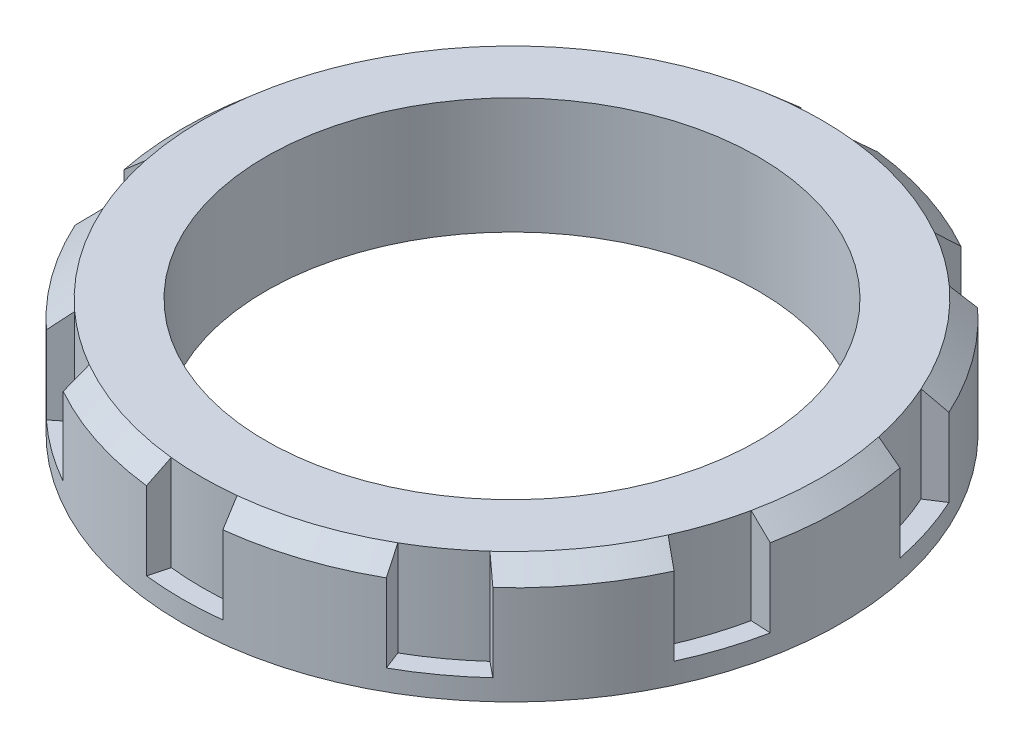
ISO-10303-21;
HEADER;
FILE_DESCRIPTION(('STEP AP214'),'2;1');
FILE_NAME('part.step','',(''),(''),'','','');
FILE_SCHEMA(('AUTOMOTIVE_DESIGN { 1 0 10303 214 1 1 1 1 }'));
ENDSEC;
DATA;
#1=APPLICATION_CONTEXT('core data for automotive mechanical design processes');
#2=APPLICATION_PROTOCOL_DEFINITION('international standard','automotive_design',2000,#1);
#3=PRODUCT_CONTEXT('',#1,'mechanical');
#4=PRODUCT('Part','Part','',(#3));
#5=PRODUCT_RELATED_PRODUCT_CATEGORY('part','',(#4));
#6=PRODUCT_DEFINITION_FORMATION('','',#4);
#7=PRODUCT_DEFINITION_CONTEXT('part definition',#1,'design');
#8=PRODUCT_DEFINITION('design','',#6,#7);
#9=PRODUCT_DEFINITION_SHAPE('','',#8);
#10=(LENGTH_UNIT() NAMED_UNIT(*) SI_UNIT(.MILLI.,.METRE.));
#11=(NAMED_UNIT(*) PLANE_ANGLE_UNIT() SI_UNIT($,.RADIAN.));
#12=(NAMED_UNIT(*) SI_UNIT($,.STERADIAN.) SOLID_ANGLE_UNIT());
#13=UNCERTAINTY_MEASURE_WITH_UNIT(LENGTH_MEASURE(1.E-05),#10,'distance_accuracy_value','');
#14=(GEOMETRIC_REPRESENTATION_CONTEXT(3) GLOBAL_UNCERTAINTY_ASSIGNED_CONTEXT((#13)) GLOBAL_UNIT_ASSIGNED_CONTEXT((#10,
#11,#12)) REPRESENTATION_CONTEXT('',''));
#15=CARTESIAN_POINT('',(0.,0.,0.));
#16=DIRECTION('',(0.,0.,1.));
#17=DIRECTION('',(1.,0.,0.));
#18=AXIS2_PLACEMENT_3D('',#15,#16,#17);
#19=CARTESIAN_POINT('',(0.,6.7,0.));
#20=DIRECTION('',(0.,-1.,0.));
#21=DIRECTION('',(0.,0.,-1.));
#22=AXIS2_PLACEMENT_3D('',#19,#20,#21);
#23=CONICAL_SURFACE('',#22,17.85,0.855052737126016);
#24=CARTESIAN_POINT('',(-18.6285678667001,5.69982766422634,-3.73951739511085));
#25=CARTESIAN_POINT('',(-18.4350058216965,5.86661961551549,-3.72920066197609));
#26=CARTESIAN_POINT('',(-18.2414146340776,6.03337762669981,-3.71888237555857));
#27=CARTESIAN_POINT('',(-17.8541739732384,6.36682576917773,-3.69824269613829));
#28=CARTESIAN_POINT('',(-17.660524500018,6.53351590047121,-3.68792130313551));
#29=CARTESIAN_POINT('',(-17.4668458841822,6.70017209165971,-3.67759835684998));
#30=B_SPLINE_CURVE_WITH_KNOTS('',3,(#24,#25,#26,#27,#28,#29),.UNSPECIFIED.,.F.,.F.,(4,2,4),(0.,
0.767157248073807,1.53431449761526),.UNSPECIFIED.);
#31=CARTESIAN_POINT('',(-18.6283678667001,5.7,-3.73950673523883));
#32=VERTEX_POINT('',#31);
#33=CARTESIAN_POINT('',(-17.4670458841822,6.7,-3.677609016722));
#34=VERTEX_POINT('',#33);
#35=EDGE_CURVE('E361',#32,#34,#30,.T.);
#36=ORIENTED_EDGE('',*,*,#35,.F.);
#37=CARTESIAN_POINT('',(0.,5.7,0.));
#38=DIRECTION('',(0.,-1.,0.));
#39=DIRECTION('',(0.,0.,-1.));
#40=AXIS2_PLACEMENT_3D('',#37,#38,#39);
#41=CIRCLE('',#40,19.);
#42=CARTESIAN_POINT('',(-18.6283678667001,5.7,3.73950673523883));
#43=VERTEX_POINT('',#42);
#44=EDGE_CURVE('E345',#43,#32,#41,.T.);
#45=ORIENTED_EDGE('',*,*,#44,.F.);
#46=CARTESIAN_POINT('',(-17.4668458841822,6.70017209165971,3.67759835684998));
#47=CARTESIAN_POINT('',(-17.660524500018,6.5335159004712,3.68792130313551));
#48=CARTESIAN_POINT('',(-17.8541739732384,6.36682576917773,3.69824269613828));
#49=CARTESIAN_POINT('',(-18.2414146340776,6.03337762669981,3.71888237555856));
#50=CARTESIAN_POINT('',(-18.4350058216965,5.86661961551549,3.72920066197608));
#51=CARTESIAN_POINT('',(-18.6285678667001,5.69982766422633,3.73951739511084));
#52=B_SPLINE_CURVE_WITH_KNOTS('',3,(#46,#47,#48,#49,#50,#51),.UNSPECIFIED.,.F.,.F.,(4,2,4),(0.,
0.76715724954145,1.53431449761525),.UNSPECIFIED.);
#53=CARTESIAN_POINT('',(-17.4670458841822,6.7,3.677609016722));
#54=VERTEX_POINT('',#53);
#55=EDGE_CURVE('E303',#54,#43,#52,.T.);
#56=ORIENTED_EDGE('',*,*,#55,.F.);
#57=CARTESIAN_POINT('',(0.,6.7,0.));
#58=DIRECTION('',(0.,-1.,0.));
#59=DIRECTION('',(0.,0.,-1.));
#60=AXIS2_PLACEMENT_3D('',#57,#58,#59);
#61=CIRCLE('',#60,17.85);
#62=EDGE_CURVE('E627',#54,#34,#61,.T.);
#63=ORIENTED_EDGE('',*,*,#62,.T.);
#64=EDGE_LOOP('',(#36,#45,#56,#63));
#65=FACE_BOUND('',#64,.T.);
#66=ADVANCED_FACE('F39',(#65),#23,.T.);
#67=CARTESIAN_POINT('',(-16.2925813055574,6.7002047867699,-7.29149414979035));
#68=CARTESIAN_POINT('',(-16.4553489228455,6.53353769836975,-7.3969910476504));
#69=CARTESIAN_POINT('',(-16.6180920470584,6.36683666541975,-7.50247207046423));
#70=CARTESIAN_POINT('',(-16.9435293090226,6.03336671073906,-7.71340236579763));
#71=CARTESIAN_POINT('',(-17.106223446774,5.86659778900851,-7.81885163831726));
#72=CARTESIAN_POINT('',(-17.2688930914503,5.69979492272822,-7.92428503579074));
#73=B_SPLINE_CURVE_WITH_KNOTS('',3,(#67,#68,#69,#70,#71,#72),.UNSPECIFIED.,.F.,.F.,(4,2,4),(0.,
0.767207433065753,1.53441486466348),.UNSPECIFIED.);
#74=CARTESIAN_POINT('',(-16.2927813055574,6.7,-7.29162377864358));
#75=VERTEX_POINT('',#74);
#76=CARTESIAN_POINT('',(-17.2686930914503,5.7,-7.92415540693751));
#77=VERTEX_POINT('',#76);
#78=EDGE_CURVE('E368',#75,#77,#73,.T.);
#79=ORIENTED_EDGE('',*,*,#78,.F.);
#80=CARTESIAN_POINT('',(-11.9694926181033,6.7,-13.2421201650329));
#81=VERTEX_POINT('',#80);
#82=EDGE_CURVE('E778',#75,#81,#61,.T.);
#83=ORIENTED_EDGE('',*,*,#82,.T.);
#84=CARTESIAN_POINT('',(-12.8728197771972,5.6998,-13.9749508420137));
#85=CARTESIAN_POINT('',(-12.7222804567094,5.86660122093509,-13.8528247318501));
#86=CARTESIAN_POINT('',(-12.5717184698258,6.03336849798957,-13.7306802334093));
#87=CARTESIAN_POINT('',(-12.2705491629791,6.36683516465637,-13.4863544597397));
#88=CARTESIAN_POINT('',(-12.1199418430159,6.53353455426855,-13.3641731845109));
#89=CARTESIAN_POINT('',(-11.9693118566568,6.7002,-13.2419735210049));
#90=B_SPLINE_CURVE_WITH_KNOTS('',3,(#84,#85,#86,#87,#88,#89),.UNSPECIFIED.,.F.,.F.,(4,2,4),(0.,
0.767199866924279,1.53439973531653),.UNSPECIFIED.);
#91=CARTESIAN_POINT('',(-12.8726392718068,5.7,-13.9748044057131));
#92=VERTEX_POINT('',#91);
#93=EDGE_CURVE('E397',#92,#81,#90,.T.);
#94=ORIENTED_EDGE('',*,*,#93,.F.);
#95=EDGE_CURVE('E339',#77,#92,#41,.T.);
#96=ORIENTED_EDGE('',*,*,#95,.F.);
#97=EDGE_LOOP('',(#79,#83,#94,#96));
#98=FACE_BOUND('',#97,.T.);
#99=ADVANCED_FACE('F617',(#98),#23,.T.);
#100=CARTESIAN_POINT('',(-8.89515106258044,6.70018413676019,-15.4755041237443));
#101=CARTESIAN_POINT('',(-8.9648204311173,6.53352393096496,-15.656517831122));
#102=CARTESIAN_POINT('',(-9.03447931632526,6.36682978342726,-15.837504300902));
#103=CARTESIAN_POINT('',(-9.17377611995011,6.03337360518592,-16.1994227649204));
#104=CARTESIAN_POINT('',(-9.24341403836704,5.86661157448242,-16.380354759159));
#105=CARTESIAN_POINT('',(-9.31304147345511,5.69981560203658,-16.5612595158));
#106=B_SPLINE_CURVE_WITH_KNOTS('',3,(#100,#101,#102,#103,#104,#105),.UNSPECIFIED.,.F.,.F.,(4,2,
4),(0.,0.767175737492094,1.5343514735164),.UNSPECIFIED.);
#107=CARTESIAN_POINT('',(-8.89522803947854,6.7,-15.4757041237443));
#108=VERTEX_POINT('',#107);
#109=CARTESIAN_POINT('',(-9.31296449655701,5.7,-16.5610595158));
#110=VERTEX_POINT('',#109);
#111=EDGE_CURVE('E402',#108,#110,#106,.T.);
#112=ORIENTED_EDGE('',*,*,#111,.F.);
#113=CARTESIAN_POINT('',(-1.9,6.7,-17.7485914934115));
#114=VERTEX_POINT('',#113);
#115=EDGE_CURVE('E360',#108,#114,#61,.T.);
#116=ORIENTED_EDGE('',*,*,#115,.T.);
#117=CARTESIAN_POINT('',(-2.20005339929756,5.69982188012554,-18.8724017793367));
#118=CARTESIAN_POINT('',(-2.15005065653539,5.86661575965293,-18.6851231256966));
#119=CARTESIAN_POINT('',(-2.1000403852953,6.03337569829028,-18.497816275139));
#120=CARTESIAN_POINT('',(-2.00000478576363,6.36682769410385,-18.1231461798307));
#121=CARTESIAN_POINT('',(-1.949979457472,6.53351975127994,-17.9357829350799));
#122=CARTESIAN_POINT('',(-1.89994660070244,6.70017786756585,-17.7483914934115));
#123=B_SPLINE_CURVE_WITH_KNOTS('',3,(#117,#118,#119,#120,#121,#122),.UNSPECIFIED.,.F.,.F.,(4,2,
4),(0.,0.767166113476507,1.53433222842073),.UNSPECIFIED.);
#124=CARTESIAN_POINT('',(-2.2,5.7,-18.8722017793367));
#125=VERTEX_POINT('',#124);
#126=EDGE_CURVE('E407',#125,#114,#123,.T.);
#127=ORIENTED_EDGE('',*,*,#126,.F.);
#128=EDGE_CURVE('E331',#110,#125,#41,.T.);
#129=ORIENTED_EDGE('',*,*,#128,.F.);
#130=EDGE_LOOP('',(#112,#116,#127,#129));
#131=FACE_BOUND('',#130,.T.);
#132=ADVANCED_FACE('F622',(#131),#23,.T.);
#133=CARTESIAN_POINT('',(1.89994660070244,6.70017786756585,-17.7483914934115));
#134=CARTESIAN_POINT('',(1.949979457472,6.53351975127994,-17.9357829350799));
#135=CARTESIAN_POINT('',(2.00000478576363,6.36682769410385,-18.1231461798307));
#136=CARTESIAN_POINT('',(2.1000403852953,6.03337569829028,-18.497816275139));
#137=CARTESIAN_POINT('',(2.15005065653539,5.86661575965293,-18.6851231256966));
#138=CARTESIAN_POINT('',(2.20005339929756,5.69982188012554,-18.8724017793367));
#139=B_SPLINE_CURVE_WITH_KNOTS('',3,(#133,#134,#135,#136,#137,#138),.UNSPECIFIED.,.F.,.F.,(4,2,
4),(0.,0.767166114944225,1.53433222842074),.UNSPECIFIED.);
#140=CARTESIAN_POINT('',(1.9,6.7,-17.7485914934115));
#141=VERTEX_POINT('',#140);
#142=CARTESIAN_POINT('',(2.2,5.7,-18.8722017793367));
#143=VERTEX_POINT('',#142);
#144=EDGE_CURVE('E434',#141,#143,#139,.T.);
#145=ORIENTED_EDGE('',*,*,#144,.F.);
#146=CARTESIAN_POINT('',(8.89522803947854,6.7,-15.4757041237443));
#147=VERTEX_POINT('',#146);
#148=EDGE_CURVE('E356',#141,#147,#61,.T.);
#149=ORIENTED_EDGE('',*,*,#148,.T.);
#150=CARTESIAN_POINT('',(9.31304147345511,5.69981560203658,-16.5612595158));
#151=CARTESIAN_POINT('',(9.24341403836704,5.86661157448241,-16.380354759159));
#152=CARTESIAN_POINT('',(9.17377611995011,6.03337360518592,-16.1994227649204));
#153=CARTESIAN_POINT('',(9.03447931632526,6.36682978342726,-15.837504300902));
#154=CARTESIAN_POINT('',(8.9648204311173,6.53352393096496,-15.656517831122));
#155=CARTESIAN_POINT('',(8.89515106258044,6.7001841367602,-15.4755041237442));
#156=B_SPLINE_CURVE_WITH_KNOTS('',3,(#150,#151,#152,#153,#154,#155),.UNSPECIFIED.,.F.,.F.,(4,2,
4),(0.,0.767175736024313,1.53435147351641),.UNSPECIFIED.);
#157=CARTESIAN_POINT('',(9.31296449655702,5.7,-16.5610595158));
#158=VERTEX_POINT('',#157);
#159=EDGE_CURVE('E439',#158,#147,#156,.T.);
#160=ORIENTED_EDGE('',*,*,#159,.F.);
#161=EDGE_CURVE('E327',#143,#158,#41,.T.);
#162=ORIENTED_EDGE('',*,*,#161,.F.);
#163=EDGE_LOOP('',(#145,#149,#160,#162));
#164=FACE_BOUND('',#163,.T.);
#165=ADVANCED_FACE('F791',(#164),#23,.T.);
#166=CARTESIAN_POINT('',(11.9693118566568,6.7002,-13.2419735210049));
#167=CARTESIAN_POINT('',(12.1199418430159,6.53353455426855,-13.3641731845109));
#168=CARTESIAN_POINT('',(12.2705491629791,6.36683516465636,-13.4863544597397));
#169=CARTESIAN_POINT('',(12.5717184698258,6.03336849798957,-13.7306802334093));
#170=CARTESIAN_POINT('',(12.7222804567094,5.86660122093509,-13.85282473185));
#171=CARTESIAN_POINT('',(12.8728197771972,5.6998,-13.9749508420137));
#172=B_SPLINE_CURVE_WITH_KNOTS('',3,(#166,#167,#168,#169,#170,#171),.UNSPECIFIED.,.F.,.F.,(4,2,
4),(0.,0.767199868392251,1.53439973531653),.UNSPECIFIED.);
#173=CARTESIAN_POINT('',(11.9694926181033,6.7,-13.2421201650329));
#174=VERTEX_POINT('',#173);
#175=CARTESIAN_POINT('',(12.8726392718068,5.7,-13.9748044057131));
#176=VERTEX_POINT('',#175);
#177=EDGE_CURVE('E445',#174,#176,#172,.T.);
#178=ORIENTED_EDGE('',*,*,#177,.F.);
#179=CARTESIAN_POINT('',(16.2927813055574,6.7,-7.29162377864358));
#180=VERTEX_POINT('',#179);
#181=EDGE_CURVE('E359',#174,#180,#61,.T.);
#182=ORIENTED_EDGE('',*,*,#181,.T.);
#183=CARTESIAN_POINT('',(17.2688930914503,5.69979492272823,-7.92428503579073));
#184=CARTESIAN_POINT('',(17.106223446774,5.86659778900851,-7.81885163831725));
#185=CARTESIAN_POINT('',(16.9435293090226,6.03336671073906,-7.71340236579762));
#186=CARTESIAN_POINT('',(16.6180920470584,6.36683666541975,-7.50247207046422));
#187=CARTESIAN_POINT('',(16.4553489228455,6.53353769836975,-7.3969910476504));
#188=CARTESIAN_POINT('',(16.2925813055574,6.7002047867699,-7.29149414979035));
#189=B_SPLINE_CURVE_WITH_KNOTS('',3,(#183,#184,#185,#186,#187,#188),.UNSPECIFIED.,.F.,.F.,(4,2,
4),(0.,0.767207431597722,1.53441486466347),.UNSPECIFIED.);
#190=CARTESIAN_POINT('',(17.2686930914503,5.7,-7.9241554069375));
#191=VERTEX_POINT('',#190);
#192=EDGE_CURVE('E451',#191,#180,#189,.T.);
#193=ORIENTED_EDGE('',*,*,#192,.F.);
#194=EDGE_CURVE('E330',#176,#191,#41,.T.);
#195=ORIENTED_EDGE('',*,*,#194,.F.);
#196=EDGE_LOOP('',(#178,#182,#193,#195));
#197=FACE_BOUND('',#196,.T.);
#198=ADVANCED_FACE('F953',(#197),#23,.T.);
#199=CARTESIAN_POINT('',(17.4668458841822,6.70017209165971,-3.67759835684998));
#200=CARTESIAN_POINT('',(17.660524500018,6.5335159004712,-3.68792130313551));
#201=CARTESIAN_POINT('',(17.8541739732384,6.36682576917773,-3.69824269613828));
#202=CARTESIAN_POINT('',(18.2414146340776,6.03337762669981,-3.71888237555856));
#203=CARTESIAN_POINT('',(18.4350058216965,5.86661961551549,-3.72920066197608));
#204=CARTESIAN_POINT('',(18.6285678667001,5.69982766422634,-3.73951739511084));
#205=B_SPLINE_CURVE_WITH_KNOTS('',3,(#199,#200,#201,#202,#203,#204),.UNSPECIFIED.,.F.,.F.,(4,2,
4),(0.,0.76715724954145,1.53431449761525),.UNSPECIFIED.);
#206=CARTESIAN_POINT('',(17.4670458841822,6.7,-3.677609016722));
#207=VERTEX_POINT('',#206);
#208=CARTESIAN_POINT('',(18.6283678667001,5.7,-3.73950673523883));
#209=VERTEX_POINT('',#208);
#210=EDGE_CURVE('E481',#207,#209,#205,.T.);
#211=ORIENTED_EDGE('',*,*,#210,.F.);
#212=CARTESIAN_POINT('',(17.4670458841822,6.7,3.677609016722));
#213=VERTEX_POINT('',#212);
#214=EDGE_CURVE('E662',#207,#213,#61,.T.);
#215=ORIENTED_EDGE('',*,*,#214,.T.);
#216=CARTESIAN_POINT('',(18.6285678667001,5.69982766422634,3.73951739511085));
#217=CARTESIAN_POINT('',(18.4350058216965,5.86661961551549,3.72920066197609));
#218=CARTESIAN_POINT('',(18.2414146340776,6.03337762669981,3.71888237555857));
#219=CARTESIAN_POINT('',(17.8541739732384,6.36682576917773,3.69824269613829));
#220=CARTESIAN_POINT('',(17.660524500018,6.53351590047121,3.68792130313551));
#221=CARTESIAN_POINT('',(17.4668458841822,6.70017209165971,3.67759835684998));
#222=B_SPLINE_CURVE_WITH_KNOTS('',3,(#216,#217,#218,#219,#220,#221),.UNSPECIFIED.,.F.,.F.,(4,2,
4),(0.,0.767157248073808,1.53431449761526),.UNSPECIFIED.);
#223=CARTESIAN_POINT('',(18.6283678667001,5.7,3.73950673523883));
#224=VERTEX_POINT('',#223);
#225=EDGE_CURVE('E486',#224,#213,#222,.T.);
#226=ORIENTED_EDGE('',*,*,#225,.F.);
#227=EDGE_CURVE('E336',#209,#224,#41,.T.);
#228=ORIENTED_EDGE('',*,*,#227,.F.);
#229=EDGE_LOOP('',(#211,#215,#226,#228));
#230=FACE_BOUND('',#229,.T.);
#231=ADVANCED_FACE('F659',(#230),#23,.T.);
#232=CARTESIAN_POINT('',(16.2925813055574,6.7002047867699,7.29149414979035));
#233=CARTESIAN_POINT('',(16.4553489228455,6.53353769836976,7.3969910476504));
#234=CARTESIAN_POINT('',(16.6180920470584,6.36683666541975,7.50247207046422));
#235=CARTESIAN_POINT('',(16.9435293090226,6.03336671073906,7.71340236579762));
#236=CARTESIAN_POINT('',(17.106223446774,5.86659778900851,7.81885163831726));
#237=CARTESIAN_POINT('',(17.2688930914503,5.69979492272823,7.92428503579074));
#238=B_SPLINE_CURVE_WITH_KNOTS('',3,(#232,#233,#234,#235,#236,#237),.UNSPECIFIED.,.F.,.F.,(4,2,
4),(0.,0.767207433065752,1.53441486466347),.UNSPECIFIED.);
#239=CARTESIAN_POINT('',(16.2927813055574,6.7,7.29162377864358));
#240=VERTEX_POINT('',#239);
#241=CARTESIAN_POINT('',(17.2686930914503,5.7,7.9241554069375));
#242=VERTEX_POINT('',#241);
#243=EDGE_CURVE('E492',#240,#242,#238,.T.);
#244=ORIENTED_EDGE('',*,*,#243,.F.);
#245=CARTESIAN_POINT('',(11.9694926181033,6.7,13.2421201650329));
#246=VERTEX_POINT('',#245);
#247=EDGE_CURVE('E676',#240,#246,#61,.T.);
#248=ORIENTED_EDGE('',*,*,#247,.T.);
#249=CARTESIAN_POINT('',(12.8728197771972,5.6998,13.9749508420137));
#250=CARTESIAN_POINT('',(12.7222804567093,5.86660122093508,13.8528247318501));
#251=CARTESIAN_POINT('',(12.5717184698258,6.03336849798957,13.7306802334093));
#252=CARTESIAN_POINT('',(12.2705491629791,6.36683516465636,13.4863544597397));
#253=CARTESIAN_POINT('',(12.1199418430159,6.53353455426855,13.3641731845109));
#254=CARTESIAN_POINT('',(11.9693118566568,6.7002,13.2419735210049));
#255=B_SPLINE_CURVE_WITH_KNOTS('',3,(#249,#250,#251,#252,#253,#254),.UNSPECIFIED.,.F.,.F.,(4,2,
4),(0.,0.767199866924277,1.53439973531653),.UNSPECIFIED.);
#256=CARTESIAN_POINT('',(12.8726392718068,5.7,13.9748044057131));
#257=VERTEX_POINT('',#256);
#258=EDGE_CURVE('E498',#257,#246,#255,.T.);
#259=ORIENTED_EDGE('',*,*,#258,.F.);
#260=EDGE_CURVE('E640',#242,#257,#41,.T.);
#261=ORIENTED_EDGE('',*,*,#260,.F.);
#262=EDGE_LOOP('',(#244,#248,#259,#261));
#263=FACE_BOUND('',#262,.T.);
#264=ADVANCED_FACE('F966',(#263),#23,.T.);
#265=CARTESIAN_POINT('',(8.89515106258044,6.70018413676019,15.4755041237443));
#266=CARTESIAN_POINT('',(8.9648204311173,6.53352393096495,15.656517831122));
#267=CARTESIAN_POINT('',(9.03447931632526,6.36682978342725,15.837504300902));
#268=CARTESIAN_POINT('',(9.17377611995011,6.03337360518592,16.1994227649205));
#269=CARTESIAN_POINT('',(9.24341403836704,5.86661157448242,16.380354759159));
#270=CARTESIAN_POINT('',(9.31304147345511,5.69981560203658,16.5612595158));
#271=B_SPLINE_CURVE_WITH_KNOTS('',3,(#265,#266,#267,#268,#269,#270),.UNSPECIFIED.,.F.,.F.,(4,2,
4),(0.,0.767175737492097,1.53435147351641),.UNSPECIFIED.);
#272=CARTESIAN_POINT('',(8.89522803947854,6.7,15.4757041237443));
#273=VERTEX_POINT('',#272);
#274=CARTESIAN_POINT('',(9.31296449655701,5.7,16.5610595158));
#275=VERTEX_POINT('',#274);
#276=EDGE_CURVE('E528',#273,#275,#271,.T.);
#277=ORIENTED_EDGE('',*,*,#276,.F.);
#278=CARTESIAN_POINT('',(1.9,6.7,17.7485914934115));
#279=VERTEX_POINT('',#278);
#280=EDGE_CURVE('E891',#273,#279,#61,.T.);
#281=ORIENTED_EDGE('',*,*,#280,.T.);
#282=CARTESIAN_POINT('',(2.20005339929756,5.69982188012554,18.8724017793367));
#283=CARTESIAN_POINT('',(2.15005065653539,5.86661575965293,18.6851231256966));
#284=CARTESIAN_POINT('',(2.1000403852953,6.03337569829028,18.497816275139));
#285=CARTESIAN_POINT('',(2.00000478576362,6.36682769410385,18.1231461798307));
#286=CARTESIAN_POINT('',(1.949979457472,6.53351975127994,17.9357829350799));
#287=CARTESIAN_POINT('',(1.89994660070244,6.70017786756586,17.7483914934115));
#288=B_SPLINE_CURVE_WITH_KNOTS('',3,(#282,#283,#284,#285,#286,#287),.UNSPECIFIED.,.F.,.F.,(4,2,
4),(0.,0.767166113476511,1.53433222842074),.UNSPECIFIED.);
#289=CARTESIAN_POINT('',(2.2,5.7,18.8722017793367));
#290=VERTEX_POINT('',#289);
#291=EDGE_CURVE('E533',#290,#279,#288,.T.);
#292=ORIENTED_EDGE('',*,*,#291,.F.);
#293=EDGE_CURVE('E635',#275,#290,#41,.T.);
#294=ORIENTED_EDGE('',*,*,#293,.F.);
#295=EDGE_LOOP('',(#277,#281,#292,#294));
#296=FACE_BOUND('',#295,.T.);
#297=ADVANCED_FACE('F897',(#296),#23,.T.);
#298=CARTESIAN_POINT('',(-1.89994660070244,6.70017786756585,17.7483914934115));
#299=CARTESIAN_POINT('',(-1.949979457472,6.53351975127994,17.9357829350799));
#300=CARTESIAN_POINT('',(-2.00000478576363,6.36682769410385,18.1231461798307));
#301=CARTESIAN_POINT('',(-2.10004038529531,6.03337569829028,18.497816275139));
#302=CARTESIAN_POINT('',(-2.15005065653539,5.86661575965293,18.6851231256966));
#303=CARTESIAN_POINT('',(-2.20005339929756,5.69982188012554,18.8724017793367));
#304=B_SPLINE_CURVE_WITH_KNOTS('',3,(#298,#299,#300,#301,#302,#303),.UNSPECIFIED.,.F.,.F.,(4,2,
4),(0.,0.767166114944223,1.53433222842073),.UNSPECIFIED.);
#305=CARTESIAN_POINT('',(-1.9,6.7,17.7485914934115));
#306=VERTEX_POINT('',#305);
#307=CARTESIAN_POINT('',(-2.2,5.7,18.8722017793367));
#308=VERTEX_POINT('',#307);
#309=EDGE_CURVE('E539',#306,#308,#304,.T.);
#310=ORIENTED_EDGE('',*,*,#309,.F.);
#311=CARTESIAN_POINT('',(-8.89522803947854,6.7,15.4757041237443));
#312=VERTEX_POINT('',#311);
#313=EDGE_CURVE('E779',#306,#312,#61,.T.);
#314=ORIENTED_EDGE('',*,*,#313,.T.);
#315=CARTESIAN_POINT('',(-9.31304147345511,5.69981560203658,16.5612595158));
#316=CARTESIAN_POINT('',(-9.24341403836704,5.86661157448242,16.380354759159));
#317=CARTESIAN_POINT('',(-9.17377611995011,6.03337360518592,16.1994227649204));
#318=CARTESIAN_POINT('',(-9.03447931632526,6.36682978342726,15.837504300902));
#319=CARTESIAN_POINT('',(-8.9648204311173,6.53352393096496,15.656517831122));
#320=CARTESIAN_POINT('',(-8.89515106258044,6.7001841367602,15.4755041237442));
#321=B_SPLINE_CURVE_WITH_KNOTS('',3,(#315,#316,#317,#318,#319,#320),.UNSPECIFIED.,.F.,.F.,(4,2,
4),(0.,0.767175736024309,1.53435147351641),.UNSPECIFIED.);
#322=CARTESIAN_POINT('',(-9.31296449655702,5.7,16.5610595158));
#323=VERTEX_POINT('',#322);
#324=EDGE_CURVE('E545',#323,#312,#321,.T.);
#325=ORIENTED_EDGE('',*,*,#324,.F.);
#326=EDGE_CURVE('E631',#308,#323,#41,.T.);
#327=ORIENTED_EDGE('',*,*,#326,.F.);
#328=EDGE_LOOP('',(#310,#314,#325,#327));
#329=FACE_BOUND('',#328,.T.);
#330=ADVANCED_FACE('F614',(#329),#23,.T.);
#331=CARTESIAN_POINT('',(-11.9693118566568,6.7002,13.2419735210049));
#332=CARTESIAN_POINT('',(-12.1199418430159,6.53353455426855,13.3641731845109));
#333=CARTESIAN_POINT('',(-12.2705491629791,6.36683516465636,13.4863544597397));
#334=CARTESIAN_POINT('',(-12.5717184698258,6.03336849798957,13.7306802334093));
#335=CARTESIAN_POINT('',(-12.7222804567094,5.86660122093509,13.85282473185));
#336=CARTESIAN_POINT('',(-12.8728197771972,5.6998,13.9749508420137));
#337=B_SPLINE_CURVE_WITH_KNOTS('',3,(#331,#332,#333,#334,#335,#336),.UNSPECIFIED.,.F.,.F.,(4,2,
4),(0.,0.76719986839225,1.53439973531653),.UNSPECIFIED.);
#338=CARTESIAN_POINT('',(-11.9694926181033,6.7,13.2421201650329));
#339=VERTEX_POINT('',#338);
#340=CARTESIAN_POINT('',(-12.8726392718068,5.7,13.9748044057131));
#341=VERTEX_POINT('',#340);
#342=EDGE_CURVE('E574',#339,#341,#337,.T.);
#343=ORIENTED_EDGE('',*,*,#342,.F.);
#344=CARTESIAN_POINT('',(-16.2927813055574,6.7,7.29162377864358));
#345=VERTEX_POINT('',#344);
#346=EDGE_CURVE('E777',#339,#345,#61,.T.);
#347=ORIENTED_EDGE('',*,*,#346,.T.);
#348=CARTESIAN_POINT('',(-17.2688930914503,5.69979492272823,7.92428503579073));
#349=CARTESIAN_POINT('',(-17.106223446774,5.86659778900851,7.81885163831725));
#350=CARTESIAN_POINT('',(-16.9435293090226,6.03336671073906,7.71340236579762));
#351=CARTESIAN_POINT('',(-16.6180920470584,6.36683666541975,7.50247207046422));
#352=CARTESIAN_POINT('',(-16.4553489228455,6.53353769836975,7.3969910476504));
#353=CARTESIAN_POINT('',(-16.2925813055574,6.7002047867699,7.29149414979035));
#354=B_SPLINE_CURVE_WITH_KNOTS('',3,(#348,#349,#350,#351,#352,#353),.UNSPECIFIED.,.F.,.F.,(4,2,
4),(0.,0.767207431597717,1.53441486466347),.UNSPECIFIED.);
#355=CARTESIAN_POINT('',(-17.2686930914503,5.7,7.9241554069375));
#356=VERTEX_POINT('',#355);
#357=EDGE_CURVE('E579',#356,#345,#354,.T.);
#358=ORIENTED_EDGE('',*,*,#357,.F.);
#359=EDGE_CURVE('E630',#341,#356,#41,.T.);
#360=ORIENTED_EDGE('',*,*,#359,.F.);
#361=EDGE_LOOP('',(#343,#347,#358,#360));
#362=FACE_BOUND('',#361,.T.);
#363=ADVANCED_FACE('F610',(#362),#23,.T.);
#364=CARTESIAN_POINT('',(0.,6.7,0.));
#365=DIRECTION('',(0.,-1.,0.));
#366=DIRECTION('',(0.,0.,-1.));
#367=AXIS2_PLACEMENT_3D('',#364,#365,#366);
#368=CYLINDRICAL_SURFACE('',#367,19.);
#369=DIRECTION('',(0.,1.,0.));
#370=VECTOR('',#369,1.);
#371=CARTESIAN_POINT('',(-18.6283678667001,1.2,-3.73950673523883));
#372=LINE('',#371,#370);
#373=CARTESIAN_POINT('',(-18.6283678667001,1.2,-3.73950673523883));
#374=VERTEX_POINT('',#373);
#375=EDGE_CURVE('E589',#374,#32,#372,.T.);
#376=ORIENTED_EDGE('',*,*,#375,.F.);
#377=CARTESIAN_POINT('',(0.,1.2,0.));
#378=DIRECTION('',(0.,1.,0.));
#379=DIRECTION('',(0.,0.,1.));
#380=AXIS2_PLACEMENT_3D('',#377,#378,#379);
#381=CIRCLE('',#380,19.);
#382=CARTESIAN_POINT('',(-17.2686930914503,1.2,-7.92415540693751));
#383=VERTEX_POINT('',#382);
#384=EDGE_CURVE('E803',#383,#374,#381,.T.);
#385=ORIENTED_EDGE('',*,*,#384,.F.);
#386=DIRECTION('',(0.,1.,0.));
#387=VECTOR('',#386,1.);
#388=CARTESIAN_POINT('',(-17.2686930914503,1.2,-7.92415540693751));
#389=LINE('',#388,#387);
#390=EDGE_CURVE('E702',#383,#77,#389,.T.);
#391=ORIENTED_EDGE('',*,*,#390,.T.);
#392=ORIENTED_EDGE('',*,*,#95,.T.);
#393=DIRECTION('',(0.,1.,0.));
#394=VECTOR('',#393,1.);
#395=CARTESIAN_POINT('',(-12.8726392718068,1.2,-13.9748044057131));
#396=LINE('',#395,#394);
#397=CARTESIAN_POINT('',(-12.8726392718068,1.2,-13.9748044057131));
#398=VERTEX_POINT('',#397);
#399=EDGE_CURVE('E705',#398,#92,#396,.T.);
#400=ORIENTED_EDGE('',*,*,#399,.F.);
#401=CARTESIAN_POINT('',(-9.31296449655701,1.2,-16.5610595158));
#402=VERTEX_POINT('',#401);
#403=EDGE_CURVE('E801',#402,#398,#381,.T.);
#404=ORIENTED_EDGE('',*,*,#403,.F.);
#405=DIRECTION('',(0.,1.,0.));
#406=VECTOR('',#405,1.);
#407=CARTESIAN_POINT('',(-9.31296449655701,1.2,-16.5610595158));
#408=LINE('',#407,#406);
#409=EDGE_CURVE('E710',#402,#110,#408,.T.);
#410=ORIENTED_EDGE('',*,*,#409,.T.);
#411=ORIENTED_EDGE('',*,*,#128,.T.);
#412=DIRECTION('',(0.,1.,0.));
#413=VECTOR('',#412,1.);
#414=CARTESIAN_POINT('',(-2.2,1.2,-18.8722017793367));
#415=LINE('',#414,#413);
#416=CARTESIAN_POINT('',(-2.2,1.2,-18.8722017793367));
#417=VERTEX_POINT('',#416);
#418=EDGE_CURVE('E712',#417,#125,#415,.T.);
#419=ORIENTED_EDGE('',*,*,#418,.F.);
#420=CARTESIAN_POINT('',(2.2,1.2,-18.8722017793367));
#421=VERTEX_POINT('',#420);
#422=EDGE_CURVE('E796',#421,#417,#381,.T.);
#423=ORIENTED_EDGE('',*,*,#422,.F.);
#424=DIRECTION('',(0.,1.,0.));
#425=VECTOR('',#424,1.);
#426=CARTESIAN_POINT('',(2.2,1.2,-18.8722017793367));
#427=LINE('',#426,#425);
#428=EDGE_CURVE('E717',#421,#143,#427,.T.);
#429=ORIENTED_EDGE('',*,*,#428,.T.);
#430=ORIENTED_EDGE('',*,*,#161,.T.);
#431=DIRECTION('',(0.,1.,0.));
#432=VECTOR('',#431,1.);
#433=CARTESIAN_POINT('',(9.31296449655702,1.2,-16.5610595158));
#434=LINE('',#433,#432);
#435=CARTESIAN_POINT('',(9.31296449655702,1.2,-16.5610595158));
#436=VERTEX_POINT('',#435);
#437=EDGE_CURVE('E719',#436,#158,#434,.T.);
#438=ORIENTED_EDGE('',*,*,#437,.F.);
#439=CARTESIAN_POINT('',(12.8726392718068,1.2,-13.9748044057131));
#440=VERTEX_POINT('',#439);
#441=EDGE_CURVE('E800',#440,#436,#381,.T.);
#442=ORIENTED_EDGE('',*,*,#441,.F.);
#443=DIRECTION('',(0.,1.,0.));
#444=VECTOR('',#443,1.);
#445=CARTESIAN_POINT('',(12.8726392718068,1.2,-13.9748044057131));
#446=LINE('',#445,#444);
#447=EDGE_CURVE('E725',#440,#176,#446,.T.);
#448=ORIENTED_EDGE('',*,*,#447,.T.);
#449=ORIENTED_EDGE('',*,*,#194,.T.);
#450=DIRECTION('',(0.,1.,0.));
#451=VECTOR('',#450,1.);
#452=CARTESIAN_POINT('',(17.2686930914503,1.2,-7.9241554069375));
#453=LINE('',#452,#451);
#454=CARTESIAN_POINT('',(17.2686930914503,1.2,-7.9241554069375));
#455=VERTEX_POINT('',#454);
#456=EDGE_CURVE('E728',#455,#191,#453,.T.);
#457=ORIENTED_EDGE('',*,*,#456,.F.);
#458=CARTESIAN_POINT('',(18.6283678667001,1.2,-3.73950673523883));
#459=VERTEX_POINT('',#458);
#460=EDGE_CURVE('E802',#459,#455,#381,.T.);
#461=ORIENTED_EDGE('',*,*,#460,.F.);
#462=DIRECTION('',(0.,1.,0.));
#463=VECTOR('',#462,1.);
#464=CARTESIAN_POINT('',(18.6283678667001,1.2,-3.73950673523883));
#465=LINE('',#464,#463);
#466=EDGE_CURVE('E655',#459,#209,#465,.T.);
#467=ORIENTED_EDGE('',*,*,#466,.T.);
#468=ORIENTED_EDGE('',*,*,#227,.T.);
#469=DIRECTION('',(0.,1.,0.));
#470=VECTOR('',#469,1.);
#471=CARTESIAN_POINT('',(18.6283678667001,1.2,3.73950673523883));
#472=LINE('',#471,#470);
#473=CARTESIAN_POINT('',(18.6283678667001,1.2,3.73950673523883));
#474=VERTEX_POINT('',#473);
#475=EDGE_CURVE('E653',#474,#224,#472,.T.);
#476=ORIENTED_EDGE('',*,*,#475,.F.);
#477=CARTESIAN_POINT('',(17.2686930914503,1.2,7.9241554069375));
#478=VERTEX_POINT('',#477);
#479=EDGE_CURVE('E48',#478,#474,#381,.T.);
#480=ORIENTED_EDGE('',*,*,#479,.F.);
#481=DIRECTION('',(0.,1.,0.));
#482=VECTOR('',#481,1.);
#483=CARTESIAN_POINT('',(17.2686930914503,1.2,7.9241554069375));
#484=LINE('',#483,#482);
#485=EDGE_CURVE('E739',#478,#242,#484,.T.);
#486=ORIENTED_EDGE('',*,*,#485,.T.);
#487=ORIENTED_EDGE('',*,*,#260,.T.);
#488=DIRECTION('',(0.,1.,0.));
#489=VECTOR('',#488,1.);
#490=CARTESIAN_POINT('',(12.8726392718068,1.2,13.9748044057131));
#491=LINE('',#490,#489);
#492=CARTESIAN_POINT('',(12.8726392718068,1.2,13.9748044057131));
#493=VERTEX_POINT('',#492);
#494=EDGE_CURVE('E741',#493,#257,#491,.T.);
#495=ORIENTED_EDGE('',*,*,#494,.F.);
#496=CARTESIAN_POINT('',(9.31296449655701,1.2,16.5610595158));
#497=VERTEX_POINT('',#496);
#498=EDGE_CURVE('E11',#497,#493,#381,.T.);
#499=ORIENTED_EDGE('',*,*,#498,.F.);
#500=DIRECTION('',(0.,1.,0.));
#501=VECTOR('',#500,1.);
#502=CARTESIAN_POINT('',(9.31296449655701,1.2,16.5610595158));
#503=LINE('',#502,#501);
#504=EDGE_CURVE('E747',#497,#275,#503,.T.);
#505=ORIENTED_EDGE('',*,*,#504,.T.);
#506=ORIENTED_EDGE('',*,*,#293,.T.);
#507=DIRECTION('',(0.,1.,0.));
#508=VECTOR('',#507,1.);
#509=CARTESIAN_POINT('',(2.2,1.2,18.8722017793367));
#510=LINE('',#509,#508);
#511=CARTESIAN_POINT('',(2.2,1.2,18.8722017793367));
#512=VERTEX_POINT('',#511);
#513=EDGE_CURVE('E749',#512,#290,#510,.T.);
#514=ORIENTED_EDGE('',*,*,#513,.F.);
#515=CARTESIAN_POINT('',(-2.2,1.2,18.8722017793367));
#516=VERTEX_POINT('',#515);
#517=EDGE_CURVE('E328',#516,#512,#381,.T.);
#518=ORIENTED_EDGE('',*,*,#517,.F.);
#519=DIRECTION('',(0.,1.,0.));
#520=VECTOR('',#519,1.);
#521=CARTESIAN_POINT('',(-2.2,1.2,18.8722017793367));
#522=LINE('',#521,#520);
#523=EDGE_CURVE('E755',#516,#308,#522,.T.);
#524=ORIENTED_EDGE('',*,*,#523,.T.);
#525=ORIENTED_EDGE('',*,*,#326,.T.);
#526=DIRECTION('',(0.,1.,0.));
#527=VECTOR('',#526,1.);
#528=CARTESIAN_POINT('',(-9.31296449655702,1.2,16.5610595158));
#529=LINE('',#528,#527);
#530=CARTESIAN_POINT('',(-9.31296449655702,1.2,16.5610595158));
#531=VERTEX_POINT('',#530);
#532=EDGE_CURVE('E757',#531,#323,#529,.T.);
#533=ORIENTED_EDGE('',*,*,#532,.F.);
#534=CARTESIAN_POINT('',(-12.8726392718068,1.2,13.9748044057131));
#535=VERTEX_POINT('',#534);
#536=EDGE_CURVE('E326',#535,#531,#381,.T.);
#537=ORIENTED_EDGE('',*,*,#536,.F.);
#538=DIRECTION('',(0.,1.,0.));
#539=VECTOR('',#538,1.);
#540=CARTESIAN_POINT('',(-12.8726392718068,1.2,13.9748044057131));
#541=LINE('',#540,#539);
#542=EDGE_CURVE('E763',#535,#341,#541,.T.);
#543=ORIENTED_EDGE('',*,*,#542,.T.);
#544=ORIENTED_EDGE('',*,*,#359,.T.);
#545=DIRECTION('',(0.,1.,0.));
#546=VECTOR('',#545,1.);
#547=CARTESIAN_POINT('',(-17.2686930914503,1.2,7.9241554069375));
#548=LINE('',#547,#546);
#549=CARTESIAN_POINT('',(-17.2686930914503,1.2,7.9241554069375));
#550=VERTEX_POINT('',#549);
#551=EDGE_CURVE('E325',#550,#356,#548,.T.);
#552=ORIENTED_EDGE('',*,*,#551,.F.);
#553=CARTESIAN_POINT('',(-18.6283678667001,1.2,3.73950673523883));
#554=VERTEX_POINT('',#553);
#555=EDGE_CURVE('E43',#554,#550,#381,.T.);
#556=ORIENTED_EDGE('',*,*,#555,.F.);
#557=DIRECTION('',(0.,1.,0.));
#558=VECTOR('',#557,1.);
#559=CARTESIAN_POINT('',(-18.6283678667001,1.2,3.73950673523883));
#560=LINE('',#559,#558);
#561=EDGE_CURVE('E298',#554,#43,#560,.T.);
#562=ORIENTED_EDGE('',*,*,#561,.T.);
#563=ORIENTED_EDGE('',*,*,#44,.T.);
#564=EDGE_LOOP('',(#376,#385,#391,#392,#400,#404,#410,#411,#419,#423,#429,#430,#438,#442,#448,
#449,#457,#461,#467,#468,#476,#480,#486,#487,#495,#499,#505,#506,#514,#518,#524,#525,#533,#537,
#543,#544,#552,#556,#562,#563));
#565=FACE_BOUND('',#564,.T.);
#566=CARTESIAN_POINT('',(0.,0.,0.));
#567=DIRECTION('',(0.,-1.,0.));
#568=DIRECTION('',(0.,0.,-1.));
#569=AXIS2_PLACEMENT_3D('',#566,#567,#568);
#570=CIRCLE('',#569,19.);
#571=CARTESIAN_POINT('',(0.,0.,-19.));
#572=VERTEX_POINT('',#571);
#573=EDGE_CURVE('E340',#572,#572,#570,.T.);
#574=ORIENTED_EDGE('',*,*,#573,.F.);
#575=EDGE_LOOP('',(#574));
#576=FACE_BOUND('',#575,.T.);
#577=ADVANCED_FACE('F322',(#565,#576),#368,.T.);
#578=CARTESIAN_POINT('',(-19.,0.,0.));
#579=DIRECTION('',(0.,1.,0.));
#580=DIRECTION('',(0.,0.,1.));
#581=AXIS2_PLACEMENT_3D('',#578,#579,#580);
#582=PLANE('',#581);
#583=CARTESIAN_POINT('',(0.,0.,0.));
#584=DIRECTION('',(0.,-1.,0.));
#585=DIRECTION('',(0.,0.,-1.));
#586=AXIS2_PLACEMENT_3D('',#583,#584,#585);
#587=CIRCLE('',#586,14.188);
#588=CARTESIAN_POINT('',(0.,0.,-14.188));
#589=VERTEX_POINT('',#588);
#590=EDGE_CURVE('E347',#589,#589,#587,.T.);
#591=ORIENTED_EDGE('',*,*,#590,.F.);
#592=EDGE_LOOP('',(#591));
#593=FACE_BOUND('',#592,.T.);
#594=ORIENTED_EDGE('',*,*,#573,.T.);
#595=EDGE_LOOP('',(#594));
#596=FACE_BOUND('',#595,.T.);
#597=ADVANCED_FACE('F605',(#593,#596),#582,.F.);
#598=CARTESIAN_POINT('',(0.,6.7,0.));
#599=DIRECTION('',(0.,-1.,0.));
#600=DIRECTION('',(0.,0.,-1.));
#601=AXIS2_PLACEMENT_3D('',#598,#599,#600);
#602=CYLINDRICAL_SURFACE('',#601,14.188);
#603=CARTESIAN_POINT('',(0.,6.7,0.));
#604=DIRECTION('',(0.,-1.,0.));
#605=DIRECTION('',(0.,0.,-1.));
#606=AXIS2_PLACEMENT_3D('',#603,#604,#605);
#607=CIRCLE('',#606,14.188);
#608=CARTESIAN_POINT('',(0.,6.7,-14.188));
#609=VERTEX_POINT('',#608);
#610=EDGE_CURVE('E351',#609,#609,#607,.T.);
#611=ORIENTED_EDGE('',*,*,#610,.F.);
#612=EDGE_LOOP('',(#611));
#613=FACE_BOUND('',#612,.T.);
#614=ORIENTED_EDGE('',*,*,#590,.T.);
#615=EDGE_LOOP('',(#614));
#616=FACE_BOUND('',#615,.T.);
#617=ADVANCED_FACE('F601',(#613,#616),#602,.F.);
#618=CARTESIAN_POINT('',(-14.188,6.7,0.));
#619=DIRECTION('',(0.,-1.,0.));
#620=DIRECTION('',(0.,0.,-1.));
#621=AXIS2_PLACEMENT_3D('',#618,#619,#620);
#622=PLANE('',#621);
#623=ORIENTED_EDGE('',*,*,#148,.F.);
#624=CARTESIAN_POINT('',(0.,6.7,0.));
#625=DIRECTION('',(0.,1.,0.));
#626=DIRECTION('',(0.,0.,1.));
#627=AXIS2_PLACEMENT_3D('',#624,#625,#626);
#628=CIRCLE('',#627,17.85);
#629=EDGE_CURVE('E690',#141,#114,#628,.T.);
#630=ORIENTED_EDGE('',*,*,#629,.T.);
#631=ORIENTED_EDGE('',*,*,#115,.F.);
#632=CARTESIAN_POINT('',(0.,6.7,0.));
#633=DIRECTION('',(0.,1.,0.));
#634=DIRECTION('',(0.,0.,1.));
#635=AXIS2_PLACEMENT_3D('',#632,#633,#634);
#636=CIRCLE('',#635,17.85);
#637=EDGE_CURVE('E693',#108,#81,#636,.T.);
#638=ORIENTED_EDGE('',*,*,#637,.T.);
#639=ORIENTED_EDGE('',*,*,#82,.F.);
#640=CARTESIAN_POINT('',(0.,6.7,0.));
#641=DIRECTION('',(0.,1.,0.));
#642=DIRECTION('',(0.,0.,1.));
#643=AXIS2_PLACEMENT_3D('',#640,#641,#642);
#644=CIRCLE('',#643,17.85);
#645=EDGE_CURVE('E318',#75,#34,#644,.T.);
#646=ORIENTED_EDGE('',*,*,#645,.T.);
#647=ORIENTED_EDGE('',*,*,#62,.F.);
#648=CARTESIAN_POINT('',(0.,6.7,0.));
#649=DIRECTION('',(0.,1.,0.));
#650=DIRECTION('',(0.,0.,1.));
#651=AXIS2_PLACEMENT_3D('',#648,#649,#650);
#652=CIRCLE('',#651,17.85);
#653=EDGE_CURVE('E770',#54,#345,#652,.T.);
#654=ORIENTED_EDGE('',*,*,#653,.T.);
#655=ORIENTED_EDGE('',*,*,#346,.F.);
#656=CARTESIAN_POINT('',(0.,6.7,0.));
#657=DIRECTION('',(0.,1.,0.));
#658=DIRECTION('',(0.,0.,1.));
#659=AXIS2_PLACEMENT_3D('',#656,#657,#658);
#660=CIRCLE('',#659,17.85);
#661=EDGE_CURVE('E773',#339,#312,#660,.T.);
#662=ORIENTED_EDGE('',*,*,#661,.T.);
#663=ORIENTED_EDGE('',*,*,#313,.F.);
#664=CARTESIAN_POINT('',(0.,6.7,0.));
#665=DIRECTION('',(0.,1.,0.));
#666=DIRECTION('',(0.,0.,1.));
#667=AXIS2_PLACEMENT_3D('',#664,#665,#666);
#668=CIRCLE('',#667,17.85);
#669=EDGE_CURVE('E684',#306,#279,#668,.T.);
#670=ORIENTED_EDGE('',*,*,#669,.T.);
#671=ORIENTED_EDGE('',*,*,#280,.F.);
#672=CARTESIAN_POINT('',(0.,6.7,0.));
#673=DIRECTION('',(0.,1.,0.));
#674=DIRECTION('',(0.,0.,1.));
#675=AXIS2_PLACEMENT_3D('',#672,#673,#674);
#676=CIRCLE('',#675,17.85);
#677=EDGE_CURVE('E680',#273,#246,#676,.T.);
#678=ORIENTED_EDGE('',*,*,#677,.T.);
#679=ORIENTED_EDGE('',*,*,#247,.F.);
#680=CARTESIAN_POINT('',(0.,6.7,0.));
#681=DIRECTION('',(0.,1.,0.));
#682=DIRECTION('',(0.,0.,1.));
#683=AXIS2_PLACEMENT_3D('',#680,#681,#682);
#684=CIRCLE('',#683,17.85);
#685=EDGE_CURVE('E670',#240,#213,#684,.T.);
#686=ORIENTED_EDGE('',*,*,#685,.T.);
#687=ORIENTED_EDGE('',*,*,#214,.F.);
#688=CARTESIAN_POINT('',(0.,6.7,0.));
#689=DIRECTION('',(0.,1.,0.));
#690=DIRECTION('',(0.,0.,1.));
#691=AXIS2_PLACEMENT_3D('',#688,#689,#690);
#692=CIRCLE('',#691,17.85);
#693=EDGE_CURVE('E679',#207,#180,#692,.T.);
#694=ORIENTED_EDGE('',*,*,#693,.T.);
#695=ORIENTED_EDGE('',*,*,#181,.F.);
#696=CARTESIAN_POINT('',(0.,6.7,0.));
#697=DIRECTION('',(0.,1.,0.));
#698=DIRECTION('',(0.,0.,1.));
#699=AXIS2_PLACEMENT_3D('',#696,#697,#698);
#700=CIRCLE('',#699,17.85);
#701=EDGE_CURVE('E682',#174,#147,#700,.T.);
#702=ORIENTED_EDGE('',*,*,#701,.T.);
#703=EDGE_LOOP('',(#623,#630,#631,#638,#639,#646,#647,#654,#655,#662,#663,#670,#671,#678,#679,
#686,#687,#694,#695,#702));
#704=FACE_BOUND('',#703,.T.);
#705=ORIENTED_EDGE('',*,*,#610,.T.);
#706=EDGE_LOOP('',(#705));
#707=FACE_BOUND('',#706,.T.);
#708=ADVANCED_FACE('F598',(#704,#707),#622,.F.);
#709=CARTESIAN_POINT('',(0.,1.2,0.));
#710=DIRECTION('',(0.,1.,0.));
#711=DIRECTION('',(0.,0.,1.));
#712=AXIS2_PLACEMENT_3D('',#709,#710,#711);
#713=CYLINDRICAL_SURFACE('',#712,17.85);
#714=ORIENTED_EDGE('',*,*,#653,.F.);
#715=DIRECTION('',(0.,1.,0.));
#716=VECTOR('',#715,1.);
#717=CARTESIAN_POINT('',(-17.4670458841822,1.2,3.677609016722));
#718=LINE('',#717,#716);
#719=CARTESIAN_POINT('',(-17.4670458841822,1.2,3.677609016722));
#720=VERTEX_POINT('',#719);
#721=EDGE_CURVE('E308',#720,#54,#718,.T.);
#722=ORIENTED_EDGE('',*,*,#721,.F.);
#723=CARTESIAN_POINT('',(0.,1.2,0.));
#724=DIRECTION('',(0.,1.,0.));
#725=DIRECTION('',(0.,0.,1.));
#726=AXIS2_PLACEMENT_3D('',#723,#724,#725);
#727=CIRCLE('',#726,17.85);
#728=CARTESIAN_POINT('',(-16.2927813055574,1.2,7.29162377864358));
#729=VERTEX_POINT('',#728);
#730=EDGE_CURVE('E316',#720,#729,#727,.T.);
#731=ORIENTED_EDGE('',*,*,#730,.T.);
#732=DIRECTION('',(0.,1.,0.));
#733=VECTOR('',#732,1.);
#734=CARTESIAN_POINT('',(-16.2927813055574,1.2,7.29162377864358));
#735=LINE('',#734,#733);
#736=EDGE_CURVE('E766',#729,#345,#735,.T.);
#737=ORIENTED_EDGE('',*,*,#736,.T.);
#738=EDGE_LOOP('',(#714,#722,#731,#737));
#739=FACE_BOUND('',#738,.T.);
#740=ADVANCED_FACE('F594',(#739),#713,.T.);
#741=CARTESIAN_POINT('',(-18.6283678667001,1.2,3.73950673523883));
#742=DIRECTION('',(0.0532238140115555,0.,0.998582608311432));
#743=DIRECTION('',(0.998582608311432,0.,-0.0532238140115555));
#744=AXIS2_PLACEMENT_3D('',#741,#742,#743);
#745=PLANE('',#744);
#746=ORIENTED_EDGE('',*,*,#55,.T.);
#747=ORIENTED_EDGE('',*,*,#561,.F.);
#748=DIRECTION('',(0.998582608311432,0.,-0.0532238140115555));
#749=VECTOR('',#748,1.);
#750=CARTESIAN_POINT('',(-18.6283678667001,1.2,3.73950673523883));
#751=LINE('',#750,#749);
#752=EDGE_CURVE('E301',#554,#720,#751,.T.);
#753=ORIENTED_EDGE('',*,*,#752,.T.);
#754=ORIENTED_EDGE('',*,*,#721,.T.);
#755=EDGE_LOOP('',(#746,#747,#753,#754));
#756=FACE_BOUND('',#755,.T.);
#757=ADVANCED_FACE('F300',(#756),#745,.T.);
#758=CARTESIAN_POINT('',(-16.2927813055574,1.2,7.29162377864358));
#759=DIRECTION('',(-0.54389316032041,0.,-0.839154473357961));
#760=DIRECTION('',(-0.839154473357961,0.,0.54389316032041));
#761=AXIS2_PLACEMENT_3D('',#758,#759,#760);
#762=PLANE('',#761);
#763=ORIENTED_EDGE('',*,*,#357,.T.);
#764=ORIENTED_EDGE('',*,*,#736,.F.);
#765=DIRECTION('',(-0.839154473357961,0.,0.54389316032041));
#766=VECTOR('',#765,1.);
#767=CARTESIAN_POINT('',(-16.2927813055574,1.2,7.29162377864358));
#768=LINE('',#767,#766);
#769=EDGE_CURVE('E1409',#729,#550,#768,.T.);
#770=ORIENTED_EDGE('',*,*,#769,.T.);
#771=ORIENTED_EDGE('',*,*,#551,.T.);
#772=EDGE_LOOP('',(#763,#764,#770,#771));
#773=FACE_BOUND('',#772,.T.);
#774=ADVANCED_FACE('F571',(#773),#762,.T.);
#775=CARTESIAN_POINT('',(0.,1.2,0.));
#776=DIRECTION('',(0.,1.,0.));
#777=DIRECTION('',(0.,0.,1.));
#778=AXIS2_PLACEMENT_3D('',#775,#776,#777);
#779=PLANE('',#778);
#780=ORIENTED_EDGE('',*,*,#555,.T.);
#781=ORIENTED_EDGE('',*,*,#769,.F.);
#782=ORIENTED_EDGE('',*,*,#730,.F.);
#783=ORIENTED_EDGE('',*,*,#752,.F.);
#784=EDGE_LOOP('',(#780,#781,#782,#783));
#785=FACE_BOUND('',#784,.T.);
#786=ADVANCED_FACE('F312',(#785),#779,.T.);
#787=CARTESIAN_POINT('',(0.,1.2,0.));
#788=DIRECTION('',(0.,1.,0.));
#789=DIRECTION('',(0.,0.,1.));
#790=AXIS2_PLACEMENT_3D('',#787,#788,#789);
#791=CYLINDRICAL_SURFACE('',#790,17.85);
#792=ORIENTED_EDGE('',*,*,#661,.F.);
#793=DIRECTION('',(0.,1.,0.));
#794=VECTOR('',#793,1.);
#795=CARTESIAN_POINT('',(-11.9694926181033,1.2,13.2421201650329));
#796=LINE('',#795,#794);
#797=CARTESIAN_POINT('',(-11.9694926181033,1.2,13.2421201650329));
#798=VERTEX_POINT('',#797);
#799=EDGE_CURVE('E761',#798,#339,#796,.T.);
#800=ORIENTED_EDGE('',*,*,#799,.F.);
#801=CARTESIAN_POINT('',(0.,1.2,0.));
#802=DIRECTION('',(0.,1.,0.));
#803=DIRECTION('',(0.,0.,1.));
#804=AXIS2_PLACEMENT_3D('',#801,#802,#803);
#805=CIRCLE('',#804,17.85);
#806=CARTESIAN_POINT('',(-8.89522803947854,1.2,15.4757041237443));
#807=VERTEX_POINT('',#806);
#808=EDGE_CURVE('E1401',#798,#807,#805,.T.);
#809=ORIENTED_EDGE('',*,*,#808,.T.);
#810=DIRECTION('',(0.,1.,0.));
#811=VECTOR('',#810,1.);
#812=CARTESIAN_POINT('',(-8.89522803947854,1.2,15.4757041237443));
#813=LINE('',#812,#811);
#814=EDGE_CURVE('E759',#807,#312,#813,.T.);
#815=ORIENTED_EDGE('',*,*,#814,.T.);
#816=EDGE_LOOP('',(#792,#800,#809,#815));
#817=FACE_BOUND('',#816,.T.);
#818=ADVANCED_FACE('F563',(#817),#791,.T.);
#819=CARTESIAN_POINT('',(-12.8726392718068,1.2,13.9748044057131));
#820=DIRECTION('',(0.630011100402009,0.,0.776586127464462));
#821=DIRECTION('',(0.776586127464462,0.,-0.630011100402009));
#822=AXIS2_PLACEMENT_3D('',#819,#820,#821);
#823=PLANE('',#822);
#824=ORIENTED_EDGE('',*,*,#342,.T.);
#825=ORIENTED_EDGE('',*,*,#542,.F.);
#826=DIRECTION('',(0.776586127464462,0.,-0.630011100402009));
#827=VECTOR('',#826,1.);
#828=CARTESIAN_POINT('',(-12.8726392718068,1.2,13.9748044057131));
#829=LINE('',#828,#827);
#830=EDGE_CURVE('E1408',#535,#798,#829,.T.);
#831=ORIENTED_EDGE('',*,*,#830,.T.);
#832=ORIENTED_EDGE('',*,*,#799,.T.);
#833=EDGE_LOOP('',(#824,#825,#831,#832));
#834=FACE_BOUND('',#833,.T.);
#835=ADVANCED_FACE('F561',(#834),#823,.T.);
#836=CARTESIAN_POINT('',(-8.89522803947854,1.2,15.4757041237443));
#837=DIRECTION('',(-0.933261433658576,0.,-0.359197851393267));
#838=DIRECTION('',(-0.359197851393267,0.,0.933261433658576));
#839=AXIS2_PLACEMENT_3D('',#836,#837,#838);
#840=PLANE('',#839);
#841=ORIENTED_EDGE('',*,*,#324,.T.);
#842=ORIENTED_EDGE('',*,*,#814,.F.);
#843=DIRECTION('',(-0.359197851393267,0.,0.933261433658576));
#844=VECTOR('',#843,1.);
#845=CARTESIAN_POINT('',(-8.89522803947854,1.2,15.4757041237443));
#846=LINE('',#845,#844);
#847=EDGE_CURVE('E1404',#807,#531,#846,.T.);
#848=ORIENTED_EDGE('',*,*,#847,.T.);
#849=ORIENTED_EDGE('',*,*,#532,.T.);
#850=EDGE_LOOP('',(#841,#842,#848,#849));
#851=FACE_BOUND('',#850,.T.);
#852=ADVANCED_FACE('F556',(#851),#840,.T.);
#853=ORIENTED_EDGE('',*,*,#536,.T.);
#854=ORIENTED_EDGE('',*,*,#847,.F.);
#855=ORIENTED_EDGE('',*,*,#808,.F.);
#856=ORIENTED_EDGE('',*,*,#830,.F.);
#857=EDGE_LOOP('',(#853,#854,#855,#856));
#858=FACE_BOUND('',#857,.T.);
#859=ADVANCED_FACE('F560',(#858),#779,.T.);
#860=CARTESIAN_POINT('',(0.,1.2,0.));
#861=DIRECTION('',(0.,1.,0.));
#862=DIRECTION('',(0.,0.,1.));
#863=AXIS2_PLACEMENT_3D('',#860,#861,#862);
#864=CYLINDRICAL_SURFACE('',#863,17.85);
#865=ORIENTED_EDGE('',*,*,#669,.F.);
#866=DIRECTION('',(0.,1.,0.));
#867=VECTOR('',#866,1.);
#868=CARTESIAN_POINT('',(-1.9,1.2,17.7485914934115));
#869=LINE('',#868,#867);
#870=CARTESIAN_POINT('',(-1.9,1.2,17.7485914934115));
#871=VERTEX_POINT('',#870);
#872=EDGE_CURVE('E753',#871,#306,#869,.T.);
#873=ORIENTED_EDGE('',*,*,#872,.F.);
#874=CARTESIAN_POINT('',(0.,1.2,0.));
#875=DIRECTION('',(0.,1.,0.));
#876=DIRECTION('',(0.,0.,1.));
#877=AXIS2_PLACEMENT_3D('',#874,#875,#876);
#878=CIRCLE('',#877,17.85);
#879=CARTESIAN_POINT('',(1.9,1.2,17.7485914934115));
#880=VERTEX_POINT('',#879);
#881=EDGE_CURVE('E826',#871,#880,#878,.T.);
#882=ORIENTED_EDGE('',*,*,#881,.T.);
#883=DIRECTION('',(0.,1.,0.));
#884=VECTOR('',#883,1.);
#885=CARTESIAN_POINT('',(1.9,1.2,17.7485914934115));
#886=LINE('',#885,#884);
#887=EDGE_CURVE('E751',#880,#279,#886,.T.);
#888=ORIENTED_EDGE('',*,*,#887,.T.);
#889=EDGE_LOOP('',(#865,#873,#882,#888));
#890=FACE_BOUND('',#889,.T.);
#891=ADVANCED_FACE('F554',(#890),#864,.T.);
#892=CARTESIAN_POINT('',(-2.2,1.2,18.8722017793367));
#893=DIRECTION('',(0.966155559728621,0.,0.257960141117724));
#894=DIRECTION('',(0.257960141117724,0.,-0.966155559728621));
#895=AXIS2_PLACEMENT_3D('',#892,#893,#894);
#896=PLANE('',#895);
#897=ORIENTED_EDGE('',*,*,#309,.T.);
#898=ORIENTED_EDGE('',*,*,#523,.F.);
#899=DIRECTION('',(0.257960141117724,0.,-0.96615555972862));
#900=VECTOR('',#899,1.);
#901=CARTESIAN_POINT('',(-2.2,1.2,18.8722017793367));
#902=LINE('',#901,#900);
#903=EDGE_CURVE('E822',#516,#871,#902,.T.);
#904=ORIENTED_EDGE('',*,*,#903,.T.);
#905=ORIENTED_EDGE('',*,*,#872,.T.);
#906=EDGE_LOOP('',(#897,#898,#904,#905));
#907=FACE_BOUND('',#906,.T.);
#908=ADVANCED_FACE('F551',(#907),#896,.T.);
#909=CARTESIAN_POINT('',(1.9,1.2,17.7485914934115));
#910=DIRECTION('',(-0.966155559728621,0.,0.257960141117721));
#911=DIRECTION('',(0.257960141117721,0.,0.966155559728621));
#912=AXIS2_PLACEMENT_3D('',#909,#910,#911);
#913=PLANE('',#912);
#914=ORIENTED_EDGE('',*,*,#291,.T.);
#915=ORIENTED_EDGE('',*,*,#887,.F.);
#916=DIRECTION('',(0.25796014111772,0.,0.966155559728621));
#917=VECTOR('',#916,1.);
#918=CARTESIAN_POINT('',(1.9,1.2,17.7485914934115));
#919=LINE('',#918,#917);
#920=EDGE_CURVE('E819',#880,#512,#919,.T.);
#921=ORIENTED_EDGE('',*,*,#920,.T.);
#922=ORIENTED_EDGE('',*,*,#513,.T.);
#923=EDGE_LOOP('',(#914,#915,#921,#922));
#924=FACE_BOUND('',#923,.T.);
#925=ADVANCED_FACE('F525',(#924),#913,.T.);
#926=ORIENTED_EDGE('',*,*,#517,.T.);
#927=ORIENTED_EDGE('',*,*,#920,.F.);
#928=ORIENTED_EDGE('',*,*,#881,.F.);
#929=ORIENTED_EDGE('',*,*,#903,.F.);
#930=EDGE_LOOP('',(#926,#927,#928,#929));
#931=FACE_BOUND('',#930,.T.);
#932=ADVANCED_FACE('F519',(#931),#779,.T.);
#933=CARTESIAN_POINT('',(0.,1.2,0.));
#934=DIRECTION('',(0.,1.,0.));
#935=DIRECTION('',(0.,0.,1.));
#936=AXIS2_PLACEMENT_3D('',#933,#934,#935);
#937=CYLINDRICAL_SURFACE('',#936,17.85);
#938=ORIENTED_EDGE('',*,*,#677,.F.);
#939=DIRECTION('',(0.,1.,0.));
#940=VECTOR('',#939,1.);
#941=CARTESIAN_POINT('',(8.89522803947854,1.2,15.4757041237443));
#942=LINE('',#941,#940);
#943=CARTESIAN_POINT('',(8.89522803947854,1.2,15.4757041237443));
#944=VERTEX_POINT('',#943);
#945=EDGE_CURVE('E745',#944,#273,#942,.T.);
#946=ORIENTED_EDGE('',*,*,#945,.F.);
#947=CARTESIAN_POINT('',(0.,1.2,0.));
#948=DIRECTION('',(0.,1.,0.));
#949=DIRECTION('',(0.,0.,1.));
#950=AXIS2_PLACEMENT_3D('',#947,#948,#949);
#951=CIRCLE('',#950,17.85);
#952=CARTESIAN_POINT('',(11.9694926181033,1.2,13.2421201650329));
#953=VERTEX_POINT('',#952);
#954=EDGE_CURVE('E829',#944,#953,#951,.T.);
#955=ORIENTED_EDGE('',*,*,#954,.T.);
#956=DIRECTION('',(0.,1.,0.));
#957=VECTOR('',#956,1.);
#958=CARTESIAN_POINT('',(11.9694926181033,1.2,13.2421201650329));
#959=LINE('',#958,#957);
#960=EDGE_CURVE('E743',#953,#246,#959,.T.);
#961=ORIENTED_EDGE('',*,*,#960,.T.);
#962=EDGE_LOOP('',(#938,#946,#955,#961));
#963=FACE_BOUND('',#962,.T.);
#964=ADVANCED_FACE('F516',(#963),#937,.T.);
#965=CARTESIAN_POINT('',(9.31296449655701,1.2,16.5610595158));
#966=DIRECTION('',(0.933261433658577,0.,-0.359197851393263));
#967=DIRECTION('',(-0.359197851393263,0.,-0.933261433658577));
#968=AXIS2_PLACEMENT_3D('',#965,#966,#967);
#969=PLANE('',#968);
#970=ORIENTED_EDGE('',*,*,#276,.T.);
#971=ORIENTED_EDGE('',*,*,#504,.F.);
#972=DIRECTION('',(-0.359197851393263,0.,-0.933261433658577));
#973=VECTOR('',#972,1.);
#974=CARTESIAN_POINT('',(9.31296449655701,1.2,16.5610595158));
#975=LINE('',#974,#973);
#976=EDGE_CURVE('E825',#497,#944,#975,.T.);
#977=ORIENTED_EDGE('',*,*,#976,.T.);
#978=ORIENTED_EDGE('',*,*,#945,.T.);
#979=EDGE_LOOP('',(#970,#971,#977,#978));
#980=FACE_BOUND('',#979,.T.);
#981=ADVANCED_FACE('F514',(#980),#969,.T.);
#982=CARTESIAN_POINT('',(11.9694926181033,1.2,13.2421201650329));
#983=DIRECTION('',(-0.630011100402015,0.,0.776586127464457));
#984=DIRECTION('',(0.776586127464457,0.,0.630011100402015));
#985=AXIS2_PLACEMENT_3D('',#982,#983,#984);
#986=PLANE('',#985);
#987=ORIENTED_EDGE('',*,*,#258,.T.);
#988=ORIENTED_EDGE('',*,*,#960,.F.);
#989=DIRECTION('',(0.776586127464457,0.,0.630011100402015));
#990=VECTOR('',#989,1.);
#991=CARTESIAN_POINT('',(11.9694926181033,1.2,13.2421201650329));
#992=LINE('',#991,#990);
#993=EDGE_CURVE('E836',#953,#493,#992,.T.);
#994=ORIENTED_EDGE('',*,*,#993,.T.);
#995=ORIENTED_EDGE('',*,*,#494,.T.);
#996=EDGE_LOOP('',(#987,#988,#994,#995));
#997=FACE_BOUND('',#996,.T.);
#998=ADVANCED_FACE('F509',(#997),#986,.T.);
#999=ORIENTED_EDGE('',*,*,#498,.T.);
#1000=ORIENTED_EDGE('',*,*,#993,.F.);
#1001=ORIENTED_EDGE('',*,*,#954,.F.);
#1002=ORIENTED_EDGE('',*,*,#976,.F.);
#1003=EDGE_LOOP('',(#999,#1000,#1001,#1002));
#1004=FACE_BOUND('',#1003,.T.);
#1005=ADVANCED_FACE('F513',(#1004),#779,.T.);
#1006=CARTESIAN_POINT('',(0.,1.2,0.));
#1007=DIRECTION('',(0.,1.,0.));
#1008=DIRECTION('',(0.,0.,1.));
#1009=AXIS2_PLACEMENT_3D('',#1006,#1007,#1008);
#1010=CYLINDRICAL_SURFACE('',#1009,17.85);
#1011=ORIENTED_EDGE('',*,*,#685,.F.);
#1012=DIRECTION('',(0.,1.,0.));
#1013=VECTOR('',#1012,1.);
#1014=CARTESIAN_POINT('',(16.2927813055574,1.2,7.29162377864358));
#1015=LINE('',#1014,#1013);
#1016=CARTESIAN_POINT('',(16.2927813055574,1.2,7.29162377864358));
#1017=VERTEX_POINT('',#1016);
#1018=EDGE_CURVE('E737',#1017,#240,#1015,.T.);
#1019=ORIENTED_EDGE('',*,*,#1018,.F.);
#1020=CARTESIAN_POINT('',(0.,1.2,0.));
#1021=DIRECTION('',(0.,1.,0.));
#1022=DIRECTION('',(0.,0.,1.));
#1023=AXIS2_PLACEMENT_3D('',#1020,#1021,#1022);
#1024=CIRCLE('',#1023,17.85);
#1025=CARTESIAN_POINT('',(17.4670458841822,1.2,3.677609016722));
#1026=VERTEX_POINT('',#1025);
#1027=EDGE_CURVE('E842',#1017,#1026,#1024,.T.);
#1028=ORIENTED_EDGE('',*,*,#1027,.T.);
#1029=DIRECTION('',(0.,1.,0.));
#1030=VECTOR('',#1029,1.);
#1031=CARTESIAN_POINT('',(17.4670458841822,1.2,3.677609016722));
#1032=LINE('',#1031,#1030);
#1033=EDGE_CURVE('E666',#1026,#213,#1032,.T.);
#1034=ORIENTED_EDGE('',*,*,#1033,.T.);
#1035=EDGE_LOOP('',(#1011,#1019,#1028,#1034));
#1036=FACE_BOUND('',#1035,.T.);
#1037=ADVANCED_FACE('F507',(#1036),#1010,.T.);
#1038=CARTESIAN_POINT('',(17.2686930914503,1.2,7.9241554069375));
#1039=DIRECTION('',(0.543893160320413,0.,-0.839154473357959));
#1040=DIRECTION('',(-0.839154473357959,0.,-0.543893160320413));
#1041=AXIS2_PLACEMENT_3D('',#1038,#1039,#1040);
#1042=PLANE('',#1041);
#1043=ORIENTED_EDGE('',*,*,#243,.T.);
#1044=ORIENTED_EDGE('',*,*,#485,.F.);
#1045=DIRECTION('',(-0.839154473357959,0.,-0.543893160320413));
#1046=VECTOR('',#1045,1.);
#1047=CARTESIAN_POINT('',(17.2686930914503,1.2,7.9241554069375));
#1048=LINE('',#1047,#1046);
#1049=EDGE_CURVE('E839',#478,#1017,#1048,.T.);
#1050=ORIENTED_EDGE('',*,*,#1049,.T.);
#1051=ORIENTED_EDGE('',*,*,#1018,.T.);
#1052=EDGE_LOOP('',(#1043,#1044,#1050,#1051));
#1053=FACE_BOUND('',#1052,.T.);
#1054=ADVANCED_FACE('F504',(#1053),#1042,.T.);
#1055=CARTESIAN_POINT('',(17.4670458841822,1.2,3.677609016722));
#1056=DIRECTION('',(-0.0532238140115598,0.,0.998582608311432));
#1057=DIRECTION('',(0.998582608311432,0.,0.0532238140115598));
#1058=AXIS2_PLACEMENT_3D('',#1055,#1056,#1057);
#1059=PLANE('',#1058);
#1060=ORIENTED_EDGE('',*,*,#225,.T.);
#1061=ORIENTED_EDGE('',*,*,#1033,.F.);
#1062=DIRECTION('',(0.998582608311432,0.,0.0532238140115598));
#1063=VECTOR('',#1062,1.);
#1064=CARTESIAN_POINT('',(17.4670458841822,1.2,3.677609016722));
#1065=LINE('',#1064,#1063);
#1066=EDGE_CURVE('E845',#1026,#474,#1065,.T.);
#1067=ORIENTED_EDGE('',*,*,#1066,.T.);
#1068=ORIENTED_EDGE('',*,*,#475,.T.);
#1069=EDGE_LOOP('',(#1060,#1061,#1067,#1068));
#1070=FACE_BOUND('',#1069,.T.);
#1071=ADVANCED_FACE('F478',(#1070),#1059,.T.);
#1072=ORIENTED_EDGE('',*,*,#479,.T.);
#1073=ORIENTED_EDGE('',*,*,#1066,.F.);
#1074=ORIENTED_EDGE('',*,*,#1027,.F.);
#1075=ORIENTED_EDGE('',*,*,#1049,.F.);
#1076=EDGE_LOOP('',(#1072,#1073,#1074,#1075));
#1077=FACE_BOUND('',#1076,.T.);
#1078=ADVANCED_FACE('F472',(#1077),#779,.T.);
#1079=CARTESIAN_POINT('',(0.,1.2,0.));
#1080=DIRECTION('',(0.,1.,0.));
#1081=DIRECTION('',(0.,0.,1.));
#1082=AXIS2_PLACEMENT_3D('',#1079,#1080,#1081);
#1083=CYLINDRICAL_SURFACE('',#1082,17.85);
#1084=ORIENTED_EDGE('',*,*,#693,.F.);
#1085=DIRECTION('',(0.,1.,0.));
#1086=VECTOR('',#1085,1.);
#1087=CARTESIAN_POINT('',(17.4670458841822,1.2,-3.677609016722));
#1088=LINE('',#1087,#1086);
#1089=CARTESIAN_POINT('',(17.4670458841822,1.2,-3.677609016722));
#1090=VERTEX_POINT('',#1089);
#1091=EDGE_CURVE('E732',#1090,#207,#1088,.T.);
#1092=ORIENTED_EDGE('',*,*,#1091,.F.);
#1093=CARTESIAN_POINT('',(0.,1.2,0.));
#1094=DIRECTION('',(0.,1.,0.));
#1095=DIRECTION('',(0.,0.,1.));
#1096=AXIS2_PLACEMENT_3D('',#1093,#1094,#1095);
#1097=CIRCLE('',#1096,17.85);
#1098=CARTESIAN_POINT('',(16.2927813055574,1.2,-7.29162377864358));
#1099=VERTEX_POINT('',#1098);
#1100=EDGE_CURVE('E850',#1090,#1099,#1097,.T.);
#1101=ORIENTED_EDGE('',*,*,#1100,.T.);
#1102=DIRECTION('',(0.,1.,0.));
#1103=VECTOR('',#1102,1.);
#1104=CARTESIAN_POINT('',(16.2927813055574,1.2,-7.29162377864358));
#1105=LINE('',#1104,#1103);
#1106=EDGE_CURVE('E730',#1099,#180,#1105,.T.);
#1107=ORIENTED_EDGE('',*,*,#1106,.T.);
#1108=EDGE_LOOP('',(#1084,#1092,#1101,#1107));
#1109=FACE_BOUND('',#1108,.T.);
#1110=ADVANCED_FACE('F469',(#1109),#1083,.T.);
#1111=CARTESIAN_POINT('',(18.6283678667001,1.2,-3.73950673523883));
#1112=DIRECTION('',(-0.0532238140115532,0.,-0.998582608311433));
#1113=DIRECTION('',(-0.998582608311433,0.,0.0532238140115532));
#1114=AXIS2_PLACEMENT_3D('',#1111,#1112,#1113);
#1115=PLANE('',#1114);
#1116=ORIENTED_EDGE('',*,*,#210,.T.);
#1117=ORIENTED_EDGE('',*,*,#466,.F.);
#1118=DIRECTION('',(-0.998582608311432,0.,0.0532238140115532));
#1119=VECTOR('',#1118,1.);
#1120=CARTESIAN_POINT('',(18.6283678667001,1.2,-3.73950673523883));
#1121=LINE('',#1120,#1119);
#1122=EDGE_CURVE('E847',#459,#1090,#1121,.T.);
#1123=ORIENTED_EDGE('',*,*,#1122,.T.);
#1124=ORIENTED_EDGE('',*,*,#1091,.T.);
#1125=EDGE_LOOP('',(#1116,#1117,#1123,#1124));
#1126=FACE_BOUND('',#1125,.T.);
#1127=ADVANCED_FACE('F467',(#1126),#1115,.T.);
#1128=CARTESIAN_POINT('',(16.2927813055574,1.2,-7.29162377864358));
#1129=DIRECTION('',(0.543893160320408,0.,0.839154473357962));
#1130=DIRECTION('',(0.839154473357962,0.,-0.543893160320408));
#1131=AXIS2_PLACEMENT_3D('',#1128,#1129,#1130);
#1132=PLANE('',#1131);
#1133=ORIENTED_EDGE('',*,*,#192,.T.);
#1134=ORIENTED_EDGE('',*,*,#1106,.F.);
#1135=DIRECTION('',(0.839154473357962,0.,-0.543893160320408));
#1136=VECTOR('',#1135,1.);
#1137=CARTESIAN_POINT('',(16.2927813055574,1.2,-7.29162377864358));
#1138=LINE('',#1137,#1136);
#1139=EDGE_CURVE('E853',#1099,#455,#1138,.T.);
#1140=ORIENTED_EDGE('',*,*,#1139,.T.);
#1141=ORIENTED_EDGE('',*,*,#456,.T.);
#1142=EDGE_LOOP('',(#1133,#1134,#1140,#1141));
#1143=FACE_BOUND('',#1142,.T.);
#1144=ADVANCED_FACE('F462',(#1143),#1132,.T.);
#1145=ORIENTED_EDGE('',*,*,#460,.T.);
#1146=ORIENTED_EDGE('',*,*,#1139,.F.);
#1147=ORIENTED_EDGE('',*,*,#1100,.F.);
#1148=ORIENTED_EDGE('',*,*,#1122,.F.);
#1149=EDGE_LOOP('',(#1145,#1146,#1147,#1148));
#1150=FACE_BOUND('',#1149,.T.);
#1151=ADVANCED_FACE('F466',(#1150),#779,.T.);
#1152=CARTESIAN_POINT('',(0.,1.2,0.));
#1153=DIRECTION('',(0.,1.,0.));
#1154=DIRECTION('',(0.,0.,1.));
#1155=AXIS2_PLACEMENT_3D('',#1152,#1153,#1154);
#1156=CYLINDRICAL_SURFACE('',#1155,17.85);
#1157=ORIENTED_EDGE('',*,*,#701,.F.);
#1158=DIRECTION('',(0.,1.,0.));
#1159=VECTOR('',#1158,1.);
#1160=CARTESIAN_POINT('',(11.9694926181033,1.2,-13.2421201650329));
#1161=LINE('',#1160,#1159);
#1162=CARTESIAN_POINT('',(11.9694926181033,1.2,-13.2421201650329));
#1163=VERTEX_POINT('',#1162);
#1164=EDGE_CURVE('E723',#1163,#174,#1161,.T.);
#1165=ORIENTED_EDGE('',*,*,#1164,.F.);
#1166=CARTESIAN_POINT('',(0.,1.2,0.));
#1167=DIRECTION('',(0.,1.,0.));
#1168=DIRECTION('',(0.,0.,1.));
#1169=AXIS2_PLACEMENT_3D('',#1166,#1167,#1168);
#1170=CIRCLE('',#1169,17.85);
#1171=CARTESIAN_POINT('',(8.89522803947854,1.2,-15.4757041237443));
#1172=VERTEX_POINT('',#1171);
#1173=EDGE_CURVE('E859',#1163,#1172,#1170,.T.);
#1174=ORIENTED_EDGE('',*,*,#1173,.T.);
#1175=DIRECTION('',(0.,1.,0.));
#1176=VECTOR('',#1175,1.);
#1177=CARTESIAN_POINT('',(8.89522803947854,1.2,-15.4757041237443));
#1178=LINE('',#1177,#1176);
#1179=EDGE_CURVE('E721',#1172,#147,#1178,.T.);
#1180=ORIENTED_EDGE('',*,*,#1179,.T.);
#1181=EDGE_LOOP('',(#1157,#1165,#1174,#1180));
#1182=FACE_BOUND('',#1181,.T.);
#1183=ADVANCED_FACE('F460',(#1182),#1156,.T.);
#1184=CARTESIAN_POINT('',(12.8726392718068,1.2,-13.9748044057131));
#1185=DIRECTION('',(-0.630011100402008,0.,-0.776586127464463));
#1186=DIRECTION('',(-0.776586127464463,0.,0.630011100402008));
#1187=AXIS2_PLACEMENT_3D('',#1184,#1185,#1186);
#1188=PLANE('',#1187);
#1189=ORIENTED_EDGE('',*,*,#177,.T.);
#1190=ORIENTED_EDGE('',*,*,#447,.F.);
#1191=DIRECTION('',(-0.776586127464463,0.,0.630011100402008));
#1192=VECTOR('',#1191,1.);
#1193=CARTESIAN_POINT('',(12.8726392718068,1.2,-13.9748044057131));
#1194=LINE('',#1193,#1192);
#1195=EDGE_CURVE('E856',#440,#1163,#1194,.T.);
#1196=ORIENTED_EDGE('',*,*,#1195,.T.);
#1197=ORIENTED_EDGE('',*,*,#1164,.T.);
#1198=EDGE_LOOP('',(#1189,#1190,#1196,#1197));
#1199=FACE_BOUND('',#1198,.T.);
#1200=ADVANCED_FACE('F457',(#1199),#1188,.T.);
#1201=CARTESIAN_POINT('',(8.89522803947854,1.2,-15.4757041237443));
#1202=DIRECTION('',(0.933261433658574,0.,0.359197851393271));
#1203=DIRECTION('',(0.359197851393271,0.,-0.933261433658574));
#1204=AXIS2_PLACEMENT_3D('',#1201,#1202,#1203);
#1205=PLANE('',#1204);
#1206=ORIENTED_EDGE('',*,*,#159,.T.);
#1207=ORIENTED_EDGE('',*,*,#1179,.F.);
#1208=DIRECTION('',(0.359197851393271,0.,-0.933261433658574));
#1209=VECTOR('',#1208,1.);
#1210=CARTESIAN_POINT('',(8.89522803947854,1.2,-15.4757041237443));
#1211=LINE('',#1210,#1209);
#1212=EDGE_CURVE('E862',#1172,#436,#1211,.T.);
#1213=ORIENTED_EDGE('',*,*,#1212,.T.);
#1214=ORIENTED_EDGE('',*,*,#437,.T.);
#1215=EDGE_LOOP('',(#1206,#1207,#1213,#1214));
#1216=FACE_BOUND('',#1215,.T.);
#1217=ADVANCED_FACE('F431',(#1216),#1205,.T.);
#1218=ORIENTED_EDGE('',*,*,#441,.T.);
#1219=ORIENTED_EDGE('',*,*,#1212,.F.);
#1220=ORIENTED_EDGE('',*,*,#1173,.F.);
#1221=ORIENTED_EDGE('',*,*,#1195,.F.);
#1222=EDGE_LOOP('',(#1218,#1219,#1220,#1221));
#1223=FACE_BOUND('',#1222,.T.);
#1224=ADVANCED_FACE('F426',(#1223),#779,.T.);
#1225=CARTESIAN_POINT('',(0.,1.2,0.));
#1226=DIRECTION('',(0.,1.,0.));
#1227=DIRECTION('',(0.,0.,1.));
#1228=AXIS2_PLACEMENT_3D('',#1225,#1226,#1227);
#1229=CYLINDRICAL_SURFACE('',#1228,17.85);
#1230=ORIENTED_EDGE('',*,*,#629,.F.);
#1231=DIRECTION('',(0.,1.,0.));
#1232=VECTOR('',#1231,1.);
#1233=CARTESIAN_POINT('',(1.9,1.2,-17.7485914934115));
#1234=LINE('',#1233,#1232);
#1235=CARTESIAN_POINT('',(1.9,1.2,-17.7485914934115));
#1236=VERTEX_POINT('',#1235);
#1237=EDGE_CURVE('E715',#1236,#141,#1234,.T.);
#1238=ORIENTED_EDGE('',*,*,#1237,.F.);
#1239=CARTESIAN_POINT('',(0.,1.2,0.));
#1240=DIRECTION('',(0.,1.,0.));
#1241=DIRECTION('',(0.,0.,1.));
#1242=AXIS2_PLACEMENT_3D('',#1239,#1240,#1241);
#1243=CIRCLE('',#1242,17.85);
#1244=CARTESIAN_POINT('',(-1.9,1.2,-17.7485914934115));
#1245=VERTEX_POINT('',#1244);
#1246=EDGE_CURVE('E867',#1236,#1245,#1243,.T.);
#1247=ORIENTED_EDGE('',*,*,#1246,.T.);
#1248=DIRECTION('',(0.,1.,0.));
#1249=VECTOR('',#1248,1.);
#1250=CARTESIAN_POINT('',(-1.9,1.2,-17.7485914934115));
#1251=LINE('',#1250,#1249);
#1252=EDGE_CURVE('E55',#1245,#114,#1251,.T.);
#1253=ORIENTED_EDGE('',*,*,#1252,.T.);
#1254=EDGE_LOOP('',(#1230,#1238,#1247,#1253));
#1255=FACE_BOUND('',#1254,.T.);
#1256=ADVANCED_FACE('F423',(#1255),#1229,.T.);
#1257=CARTESIAN_POINT('',(2.2,1.2,-18.8722017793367));
#1258=DIRECTION('',(-0.966155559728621,0.,-0.257960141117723));
#1259=DIRECTION('',(-0.257960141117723,0.,0.966155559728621));
#1260=AXIS2_PLACEMENT_3D('',#1257,#1258,#1259);
#1261=PLANE('',#1260);
#1262=ORIENTED_EDGE('',*,*,#144,.T.);
#1263=ORIENTED_EDGE('',*,*,#428,.F.);
#1264=DIRECTION('',(-0.257960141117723,0.,0.966155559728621));
#1265=VECTOR('',#1264,1.);
#1266=CARTESIAN_POINT('',(2.2,1.2,-18.8722017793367));
#1267=LINE('',#1266,#1265);
#1268=EDGE_CURVE('E865',#421,#1236,#1267,.T.);
#1269=ORIENTED_EDGE('',*,*,#1268,.T.);
#1270=ORIENTED_EDGE('',*,*,#1237,.T.);
#1271=EDGE_LOOP('',(#1262,#1263,#1269,#1270));
#1272=FACE_BOUND('',#1271,.T.);
#1273=ADVANCED_FACE('F421',(#1272),#1261,.T.);
#1274=CARTESIAN_POINT('',(-1.9,1.2,-17.7485914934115));
#1275=DIRECTION('',(0.966155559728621,0.,-0.257960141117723));
#1276=DIRECTION('',(-0.257960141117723,0.,-0.966155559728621));
#1277=AXIS2_PLACEMENT_3D('',#1274,#1275,#1276);
#1278=PLANE('',#1277);
#1279=ORIENTED_EDGE('',*,*,#126,.T.);
#1280=ORIENTED_EDGE('',*,*,#1252,.F.);
#1281=DIRECTION('',(-0.257960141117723,0.,-0.966155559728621));
#1282=VECTOR('',#1281,1.);
#1283=CARTESIAN_POINT('',(-1.9,1.2,-17.7485914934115));
#1284=LINE('',#1283,#1282);
#1285=EDGE_CURVE('E869',#1245,#417,#1284,.T.);
#1286=ORIENTED_EDGE('',*,*,#1285,.T.);
#1287=ORIENTED_EDGE('',*,*,#418,.T.);
#1288=EDGE_LOOP('',(#1279,#1280,#1286,#1287));
#1289=FACE_BOUND('',#1288,.T.);
#1290=ADVANCED_FACE('F416',(#1289),#1278,.T.);
#1291=ORIENTED_EDGE('',*,*,#422,.T.);
#1292=ORIENTED_EDGE('',*,*,#1285,.F.);
#1293=ORIENTED_EDGE('',*,*,#1246,.F.);
#1294=ORIENTED_EDGE('',*,*,#1268,.F.);
#1295=EDGE_LOOP('',(#1291,#1292,#1293,#1294));
#1296=FACE_BOUND('',#1295,.T.);
#1297=ADVANCED_FACE('F420',(#1296),#779,.T.);
#1298=CARTESIAN_POINT('',(0.,1.2,0.));
#1299=DIRECTION('',(0.,1.,0.));
#1300=DIRECTION('',(0.,0.,1.));
#1301=AXIS2_PLACEMENT_3D('',#1298,#1299,#1300);
#1302=CYLINDRICAL_SURFACE('',#1301,17.85);
#1303=ORIENTED_EDGE('',*,*,#637,.F.);
#1304=DIRECTION('',(0.,1.,0.));
#1305=VECTOR('',#1304,1.);
#1306=CARTESIAN_POINT('',(-8.89522803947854,1.2,-15.4757041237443));
#1307=LINE('',#1306,#1305);
#1308=CARTESIAN_POINT('',(-8.89522803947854,1.2,-15.4757041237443));
#1309=VERTEX_POINT('',#1308);
#1310=EDGE_CURVE('E708',#1309,#108,#1307,.T.);
#1311=ORIENTED_EDGE('',*,*,#1310,.F.);
#1312=CARTESIAN_POINT('',(0.,1.2,0.));
#1313=DIRECTION('',(0.,1.,0.));
#1314=DIRECTION('',(0.,0.,1.));
#1315=AXIS2_PLACEMENT_3D('',#1312,#1313,#1314);
#1316=CIRCLE('',#1315,17.85);
#1317=CARTESIAN_POINT('',(-11.9694926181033,1.2,-13.2421201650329));
#1318=VERTEX_POINT('',#1317);
#1319=EDGE_CURVE('E874',#1309,#1318,#1316,.T.);
#1320=ORIENTED_EDGE('',*,*,#1319,.T.);
#1321=DIRECTION('',(0.,1.,0.));
#1322=VECTOR('',#1321,1.);
#1323=CARTESIAN_POINT('',(-11.9694926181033,1.2,-13.2421201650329));
#1324=LINE('',#1323,#1322);
#1325=EDGE_CURVE('E63',#1318,#81,#1324,.T.);
#1326=ORIENTED_EDGE('',*,*,#1325,.T.);
#1327=EDGE_LOOP('',(#1303,#1311,#1320,#1326));
#1328=FACE_BOUND('',#1327,.T.);
#1329=ADVANCED_FACE('F395',(#1328),#1302,.T.);
#1330=CARTESIAN_POINT('',(-9.31296449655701,1.2,-16.5610595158));
#1331=DIRECTION('',(-0.933261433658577,0.,0.359197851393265));
#1332=DIRECTION('',(0.359197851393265,0.,0.933261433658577));
#1333=AXIS2_PLACEMENT_3D('',#1330,#1331,#1332);
#1334=PLANE('',#1333);
#1335=ORIENTED_EDGE('',*,*,#111,.T.);
#1336=ORIENTED_EDGE('',*,*,#409,.F.);
#1337=DIRECTION('',(0.359197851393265,0.,0.933261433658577));
#1338=VECTOR('',#1337,1.);
#1339=CARTESIAN_POINT('',(-9.31296449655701,1.2,-16.5610595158));
#1340=LINE('',#1339,#1338);
#1341=EDGE_CURVE('E871',#402,#1309,#1340,.T.);
#1342=ORIENTED_EDGE('',*,*,#1341,.T.);
#1343=ORIENTED_EDGE('',*,*,#1310,.T.);
#1344=EDGE_LOOP('',(#1335,#1336,#1342,#1343));
#1345=FACE_BOUND('',#1344,.T.);
#1346=ADVANCED_FACE('F393',(#1345),#1334,.T.);
#1347=CARTESIAN_POINT('',(-11.9694926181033,1.2,-13.2421201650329));
#1348=DIRECTION('',(0.630011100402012,0.,-0.77658612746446));
#1349=DIRECTION('',(-0.77658612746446,0.,-0.630011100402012));
#1350=AXIS2_PLACEMENT_3D('',#1347,#1348,#1349);
#1351=PLANE('',#1350);
#1352=ORIENTED_EDGE('',*,*,#93,.T.);
#1353=ORIENTED_EDGE('',*,*,#1325,.F.);
#1354=DIRECTION('',(-0.77658612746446,0.,-0.630011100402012));
#1355=VECTOR('',#1354,1.);
#1356=CARTESIAN_POINT('',(-11.9694926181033,1.2,-13.2421201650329));
#1357=LINE('',#1356,#1355);
#1358=EDGE_CURVE('E876',#1318,#398,#1357,.T.);
#1359=ORIENTED_EDGE('',*,*,#1358,.T.);
#1360=ORIENTED_EDGE('',*,*,#399,.T.);
#1361=EDGE_LOOP('',(#1352,#1353,#1359,#1360));
#1362=FACE_BOUND('',#1361,.T.);
#1363=ADVANCED_FACE('F388',(#1362),#1351,.T.);
#1364=ORIENTED_EDGE('',*,*,#403,.T.);
#1365=ORIENTED_EDGE('',*,*,#1358,.F.);
#1366=ORIENTED_EDGE('',*,*,#1319,.F.);
#1367=ORIENTED_EDGE('',*,*,#1341,.F.);
#1368=EDGE_LOOP('',(#1364,#1365,#1366,#1367));
#1369=FACE_BOUND('',#1368,.T.);
#1370=ADVANCED_FACE('F392',(#1369),#779,.T.);
#1371=ORIENTED_EDGE('',*,*,#384,.T.);
#1372=DIRECTION('',(-0.998582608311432,0.,-0.0532238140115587));
#1373=VECTOR('',#1372,1.);
#1374=CARTESIAN_POINT('',(-17.4670458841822,1.2,-3.677609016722));
#1375=LINE('',#1374,#1373);
#1376=CARTESIAN_POINT('',(-17.4670458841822,1.2,-3.677609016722));
#1377=VERTEX_POINT('',#1376);
#1378=EDGE_CURVE('E309',#1377,#374,#1375,.T.);
#1379=ORIENTED_EDGE('',*,*,#1378,.F.);
#1380=CARTESIAN_POINT('',(0.,1.2,0.));
#1381=DIRECTION('',(0.,1.,0.));
#1382=DIRECTION('',(0.,0.,1.));
#1383=AXIS2_PLACEMENT_3D('',#1380,#1381,#1382);
#1384=CIRCLE('',#1383,17.85);
#1385=CARTESIAN_POINT('',(-16.2927813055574,1.2,-7.29162377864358));
#1386=VERTEX_POINT('',#1385);
#1387=EDGE_CURVE('E881',#1386,#1377,#1384,.T.);
#1388=ORIENTED_EDGE('',*,*,#1387,.F.);
#1389=DIRECTION('',(0.839154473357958,0.,0.543893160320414));
#1390=VECTOR('',#1389,1.);
#1391=CARTESIAN_POINT('',(-17.2686930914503,1.2,-7.92415540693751));
#1392=LINE('',#1391,#1390);
#1393=EDGE_CURVE('E878',#383,#1386,#1392,.T.);
#1394=ORIENTED_EDGE('',*,*,#1393,.F.);
#1395=EDGE_LOOP('',(#1371,#1379,#1388,#1394));
#1396=FACE_BOUND('',#1395,.T.);
#1397=ADVANCED_FACE('F379',(#1396),#779,.T.);
#1398=CARTESIAN_POINT('',(-17.4670458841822,1.2,-3.677609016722));
#1399=DIRECTION('',(0.0532238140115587,0.,-0.998582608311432));
#1400=DIRECTION('',(-0.998582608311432,0.,-0.0532238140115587));
#1401=AXIS2_PLACEMENT_3D('',#1398,#1399,#1400);
#1402=PLANE('',#1401);
#1403=ORIENTED_EDGE('',*,*,#35,.T.);
#1404=DIRECTION('',(0.,1.,0.));
#1405=VECTOR('',#1404,1.);
#1406=CARTESIAN_POINT('',(-17.4670458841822,1.2,-3.677609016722));
#1407=LINE('',#1406,#1405);
#1408=EDGE_CURVE('E698',#1377,#34,#1407,.T.);
#1409=ORIENTED_EDGE('',*,*,#1408,.F.);
#1410=ORIENTED_EDGE('',*,*,#1378,.T.);
#1411=ORIENTED_EDGE('',*,*,#375,.T.);
#1412=EDGE_LOOP('',(#1403,#1409,#1410,#1411));
#1413=FACE_BOUND('',#1412,.T.);
#1414=ADVANCED_FACE('F374',(#1413),#1402,.T.);
#1415=CARTESIAN_POINT('',(-17.2686930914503,1.2,-7.92415540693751));
#1416=DIRECTION('',(-0.543893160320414,0.,0.839154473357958));
#1417=DIRECTION('',(0.839154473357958,0.,0.543893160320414));
#1418=AXIS2_PLACEMENT_3D('',#1415,#1416,#1417);
#1419=PLANE('',#1418);
#1420=ORIENTED_EDGE('',*,*,#78,.T.);
#1421=ORIENTED_EDGE('',*,*,#390,.F.);
#1422=ORIENTED_EDGE('',*,*,#1393,.T.);
#1423=DIRECTION('',(0.,1.,0.));
#1424=VECTOR('',#1423,1.);
#1425=CARTESIAN_POINT('',(-16.2927813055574,1.2,-7.29162377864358));
#1426=LINE('',#1425,#1424);
#1427=EDGE_CURVE('E700',#1386,#75,#1426,.T.);
#1428=ORIENTED_EDGE('',*,*,#1427,.T.);
#1429=EDGE_LOOP('',(#1420,#1421,#1422,#1428));
#1430=FACE_BOUND('',#1429,.T.);
#1431=ADVANCED_FACE('F378',(#1430),#1419,.T.);
#1432=CARTESIAN_POINT('',(0.,1.2,0.));
#1433=DIRECTION('',(0.,1.,0.));
#1434=DIRECTION('',(0.,0.,1.));
#1435=AXIS2_PLACEMENT_3D('',#1432,#1433,#1434);
#1436=CYLINDRICAL_SURFACE('',#1435,17.85);
#1437=ORIENTED_EDGE('',*,*,#645,.F.);
#1438=ORIENTED_EDGE('',*,*,#1427,.F.);
#1439=ORIENTED_EDGE('',*,*,#1387,.T.);
#1440=ORIENTED_EDGE('',*,*,#1408,.T.);
#1441=EDGE_LOOP('',(#1437,#1438,#1439,#1440));
#1442=FACE_BOUND('',#1441,.T.);
#1443=ADVANCED_FACE('F381',(#1442),#1436,.T.);
#1444=CLOSED_SHELL('',(#66,#99,#132,#165,#198,#231,#264,#297,#330,#363,#577,#597,#617,#708,#740,
#757,#774,#786,#818,#835,#852,#859,#891,#908,#925,#932,#964,#981,#998,#1005,#1037,#1054,#1071,
#1078,#1110,#1127,#1144,#1151,#1183,#1200,#1217,#1224,#1256,#1273,#1290,#1297,#1329,#1346,#1363,
#1370,#1397,#1414,#1431,#1443));
#1445=MANIFOLD_SOLID_BREP('B2',#1444);
#1446=ADVANCED_BREP_SHAPE_REPRESENTATION('',(#18,#1445),#14);
#1447=SHAPE_DEFINITION_REPRESENTATION(#9,#1446);
ENDSEC;
END-ISO-10303-21;
